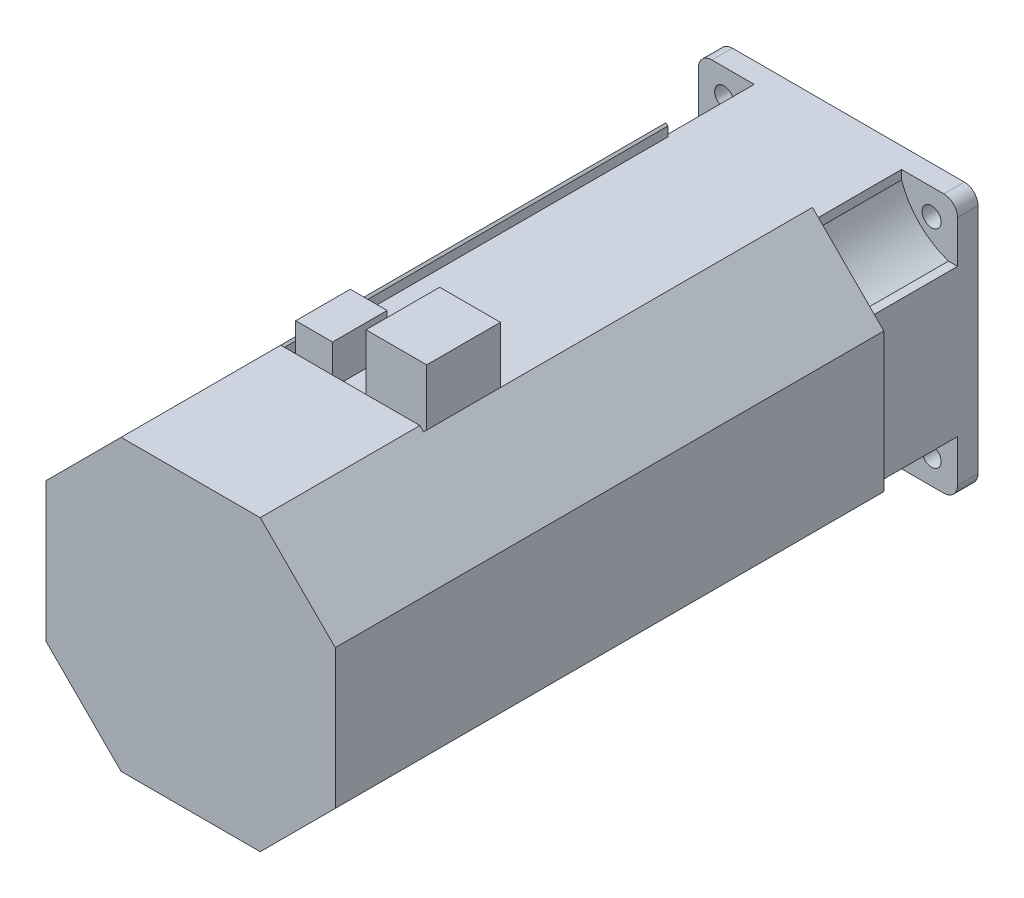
ISO-10303-21;
HEADER;
FILE_DESCRIPTION(('STEP AP214'),'2;1');
FILE_NAME('part.step','',(''),(''),'','','');
FILE_SCHEMA(('AUTOMOTIVE_DESIGN { 1 0 10303 214 1 1 1 1 }'));
ENDSEC;
DATA;
#1=APPLICATION_CONTEXT('core data for automotive mechanical design processes');
#2=APPLICATION_PROTOCOL_DEFINITION('international standard','automotive_design',2000,#1);
#3=PRODUCT_CONTEXT('',#1,'mechanical');
#4=PRODUCT('Part','Part','',(#3));
#5=PRODUCT_RELATED_PRODUCT_CATEGORY('part','',(#4));
#6=PRODUCT_DEFINITION_FORMATION('','',#4);
#7=PRODUCT_DEFINITION_CONTEXT('part definition',#1,'design');
#8=PRODUCT_DEFINITION('design','',#6,#7);
#9=PRODUCT_DEFINITION_SHAPE('','',#8);
#10=(LENGTH_UNIT() NAMED_UNIT(*) SI_UNIT(.MILLI.,.METRE.));
#11=(NAMED_UNIT(*) PLANE_ANGLE_UNIT() SI_UNIT($,.RADIAN.));
#12=(NAMED_UNIT(*) SI_UNIT($,.STERADIAN.) SOLID_ANGLE_UNIT());
#13=UNCERTAINTY_MEASURE_WITH_UNIT(LENGTH_MEASURE(1.E-05),#10,'distance_accuracy_value','');
#14=(GEOMETRIC_REPRESENTATION_CONTEXT(3) GLOBAL_UNCERTAINTY_ASSIGNED_CONTEXT((#13)) GLOBAL_UNIT_ASSIGNED_CONTEXT((#10,
#11,#12)) REPRESENTATION_CONTEXT('',''));
#15=CARTESIAN_POINT('',(0.,0.,0.));
#16=DIRECTION('',(0.,0.,1.));
#17=DIRECTION('',(1.,0.,0.));
#18=AXIS2_PLACEMENT_3D('',#15,#16,#17);
#19=CARTESIAN_POINT('',(-52.2928932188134,101.87867965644,365.));
#20=DIRECTION('',(0.,0.,-1.));
#21=DIRECTION('',(-1.,0.,0.));
#22=AXIS2_PLACEMENT_3D('',#19,#20,#21);
#23=PLANE('',#22);
#24=DIRECTION('',(-1.,0.,0.));
#25=VECTOR('',#24,1.);
#26=CARTESIAN_POINT('',(-52.2928932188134,95.,365.));
#27=LINE('',#26,#25);
#28=CARTESIAN_POINT('',(52.2928932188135,95.,365.));
#29=VERTEX_POINT('',#28);
#30=CARTESIAN_POINT('',(-52.2928932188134,95.,365.));
#31=VERTEX_POINT('',#30);
#32=EDGE_CURVE('E340',#29,#31,#27,.T.);
#33=ORIENTED_EDGE('',*,*,#32,.T.);
#34=DIRECTION('',(0.,-1.,0.));
#35=VECTOR('',#34,1.);
#36=CARTESIAN_POINT('',(-52.2928932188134,101.87867965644,365.));
#37=LINE('',#36,#35);
#38=CARTESIAN_POINT('',(-52.2928932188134,101.87867965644,365.));
#39=VERTEX_POINT('',#38);
#40=EDGE_CURVE('E705',#39,#31,#37,.T.);
#41=ORIENTED_EDGE('',*,*,#40,.F.);
#42=DIRECTION('',(-0.707106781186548,0.707106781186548,0.));
#43=VECTOR('',#42,1.);
#44=CARTESIAN_POINT('',(-53.7071067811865,103.292893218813,365.));
#45=LINE('',#44,#43);
#46=CARTESIAN_POINT('',(-53.7071067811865,103.292893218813,365.));
#47=VERTEX_POINT('',#46);
#48=EDGE_CURVE('E431',#39,#47,#45,.T.);
#49=ORIENTED_EDGE('',*,*,#48,.T.);
#50=DIRECTION('',(0.707106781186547,0.707106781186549,0.));
#51=VECTOR('',#50,1.);
#52=CARTESIAN_POINT('',(-53.7071067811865,103.292893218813,365.));
#53=LINE('',#52,#51);
#54=CARTESIAN_POINT('',(-51.,106.,365.));
#55=VERTEX_POINT('',#54);
#56=EDGE_CURVE('E429',#47,#55,#53,.T.);
#57=ORIENTED_EDGE('',*,*,#56,.T.);
#58=DIRECTION('',(1.,0.,0.));
#59=VECTOR('',#58,1.);
#60=CARTESIAN_POINT('',(-51.,106.,365.));
#61=LINE('',#60,#59);
#62=CARTESIAN_POINT('',(51.,106.,365.));
#63=VERTEX_POINT('',#62);
#64=EDGE_CURVE('E427',#55,#63,#61,.T.);
#65=ORIENTED_EDGE('',*,*,#64,.T.);
#66=DIRECTION('',(0.707106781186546,-0.70710678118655,0.));
#67=VECTOR('',#66,1.);
#68=CARTESIAN_POINT('',(51.,106.,365.));
#69=LINE('',#68,#67);
#70=CARTESIAN_POINT('',(53.7071067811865,103.292893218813,365.));
#71=VERTEX_POINT('',#70);
#72=EDGE_CURVE('E424',#63,#71,#69,.T.);
#73=ORIENTED_EDGE('',*,*,#72,.T.);
#74=DIRECTION('',(-0.707106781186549,-0.707106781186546,0.));
#75=VECTOR('',#74,1.);
#76=CARTESIAN_POINT('',(53.7071067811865,103.292893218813,365.));
#77=LINE('',#76,#75);
#78=CARTESIAN_POINT('',(52.2928932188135,101.87867965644,365.));
#79=VERTEX_POINT('',#78);
#80=EDGE_CURVE('E415',#71,#79,#77,.T.);
#81=ORIENTED_EDGE('',*,*,#80,.T.);
#82=DIRECTION('',(0.,1.,0.));
#83=VECTOR('',#82,1.);
#84=CARTESIAN_POINT('',(52.2928932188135,101.87867965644,365.));
#85=LINE('',#84,#83);
#86=EDGE_CURVE('E703',#29,#79,#85,.T.);
#87=ORIENTED_EDGE('',*,*,#86,.F.);
#88=EDGE_LOOP('',(#33,#41,#49,#57,#65,#73,#81,#87));
#89=FACE_BOUND('',#88,.T.);
#90=ADVANCED_FACE('F15',(#89),#23,.T.);
#91=CARTESIAN_POINT('',(52.9999999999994,144.,308.));
#92=DIRECTION('',(0.,0.,1.));
#93=DIRECTION('',(1.,0.,0.));
#94=AXIS2_PLACEMENT_3D('',#91,#92,#93);
#95=PLANE('',#94);
#96=DIRECTION('',(0.,1.,0.));
#97=VECTOR('',#96,1.);
#98=CARTESIAN_POINT('',(52.2928932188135,144.,308.));
#99=LINE('',#98,#97);
#100=CARTESIAN_POINT('',(52.2928932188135,95.,308.));
#101=VERTEX_POINT('',#100);
#102=CARTESIAN_POINT('',(52.2928932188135,101.87867965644,308.));
#103=VERTEX_POINT('',#102);
#104=EDGE_CURVE('E699',#101,#103,#99,.T.);
#105=ORIENTED_EDGE('',*,*,#104,.F.);
#106=DIRECTION('',(-1.,0.,0.));
#107=VECTOR('',#106,1.);
#108=CARTESIAN_POINT('',(52.9999999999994,95.,308.));
#109=LINE('',#108,#107);
#110=CARTESIAN_POINT('',(8.49999999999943,95.,308.));
#111=VERTEX_POINT('',#110);
#112=EDGE_CURVE('E605',#101,#111,#109,.T.);
#113=ORIENTED_EDGE('',*,*,#112,.T.);
#114=DIRECTION('',(0.,-1.,0.));
#115=VECTOR('',#114,1.);
#116=CARTESIAN_POINT('',(8.49999999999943,144.,308.));
#117=LINE('',#116,#115);
#118=CARTESIAN_POINT('',(8.49999999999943,144.,308.));
#119=VERTEX_POINT('',#118);
#120=EDGE_CURVE('E589',#119,#111,#117,.T.);
#121=ORIENTED_EDGE('',*,*,#120,.F.);
#122=DIRECTION('',(-1.,0.,0.));
#123=VECTOR('',#122,1.);
#124=CARTESIAN_POINT('',(52.9999999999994,144.,308.));
#125=LINE('',#124,#123);
#126=CARTESIAN_POINT('',(52.9999999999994,144.,308.));
#127=VERTEX_POINT('',#126);
#128=EDGE_CURVE('E600',#127,#119,#125,.T.);
#129=ORIENTED_EDGE('',*,*,#128,.F.);
#130=DIRECTION('',(0.,-1.,0.));
#131=VECTOR('',#130,1.);
#132=CARTESIAN_POINT('',(52.9999999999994,144.,308.));
#133=LINE('',#132,#131);
#134=CARTESIAN_POINT('',(52.9999999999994,102.585786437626,308.));
#135=VERTEX_POINT('',#134);
#136=EDGE_CURVE('E586',#127,#135,#133,.T.);
#137=ORIENTED_EDGE('',*,*,#136,.T.);
#138=DIRECTION('',(-0.707106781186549,-0.707106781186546,0.));
#139=VECTOR('',#138,1.);
#140=CARTESIAN_POINT('',(53.7071067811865,103.292893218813,308.));
#141=LINE('',#140,#139);
#142=EDGE_CURVE('E348',#135,#103,#141,.T.);
#143=ORIENTED_EDGE('',*,*,#142,.T.);
#144=EDGE_LOOP('',(#105,#113,#121,#129,#137,#143));
#145=FACE_BOUND('',#144,.T.);
#146=ADVANCED_FACE('F858',(#145),#95,.F.);
#147=CARTESIAN_POINT('',(52.9999999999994,144.,362.));
#148=DIRECTION('',(0.,0.,-1.));
#149=DIRECTION('',(-1.,0.,0.));
#150=AXIS2_PLACEMENT_3D('',#147,#148,#149);
#151=PLANE('',#150);
#152=DIRECTION('',(0.,-1.,0.));
#153=VECTOR('',#152,1.);
#154=CARTESIAN_POINT('',(52.2928932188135,144.,362.));
#155=LINE('',#154,#153);
#156=CARTESIAN_POINT('',(52.2928932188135,101.87867965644,362.));
#157=VERTEX_POINT('',#156);
#158=CARTESIAN_POINT('',(52.2928932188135,95.,362.));
#159=VERTEX_POINT('',#158);
#160=EDGE_CURVE('E23',#157,#159,#155,.T.);
#161=ORIENTED_EDGE('',*,*,#160,.F.);
#162=DIRECTION('',(0.707106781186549,0.707106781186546,0.));
#163=VECTOR('',#162,1.);
#164=CARTESIAN_POINT('',(53.7071067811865,103.292893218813,362.));
#165=LINE('',#164,#163);
#166=CARTESIAN_POINT('',(52.9999999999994,102.585786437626,362.));
#167=VERTEX_POINT('',#166);
#168=EDGE_CURVE('E354',#157,#167,#165,.T.);
#169=ORIENTED_EDGE('',*,*,#168,.T.);
#170=DIRECTION('',(0.,-1.,0.));
#171=VECTOR('',#170,1.);
#172=CARTESIAN_POINT('',(52.9999999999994,144.,362.));
#173=LINE('',#172,#171);
#174=CARTESIAN_POINT('',(52.9999999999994,144.,362.));
#175=VERTEX_POINT('',#174);
#176=EDGE_CURVE('E593',#175,#167,#173,.T.);
#177=ORIENTED_EDGE('',*,*,#176,.F.);
#178=DIRECTION('',(1.,0.,0.));
#179=VECTOR('',#178,1.);
#180=CARTESIAN_POINT('',(52.9999999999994,144.,362.));
#181=LINE('',#180,#179);
#182=CARTESIAN_POINT('',(8.49999999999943,144.,362.));
#183=VERTEX_POINT('',#182);
#184=EDGE_CURVE('E596',#183,#175,#181,.T.);
#185=ORIENTED_EDGE('',*,*,#184,.F.);
#186=DIRECTION('',(0.,-1.,0.));
#187=VECTOR('',#186,1.);
#188=CARTESIAN_POINT('',(8.49999999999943,144.,362.));
#189=LINE('',#188,#187);
#190=CARTESIAN_POINT('',(8.49999999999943,95.,362.));
#191=VERTEX_POINT('',#190);
#192=EDGE_CURVE('E328',#183,#191,#189,.T.);
#193=ORIENTED_EDGE('',*,*,#192,.T.);
#194=DIRECTION('',(1.,0.,0.));
#195=VECTOR('',#194,1.);
#196=CARTESIAN_POINT('',(52.9999999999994,95.,362.));
#197=LINE('',#196,#195);
#198=EDGE_CURVE('E320',#191,#159,#197,.T.);
#199=ORIENTED_EDGE('',*,*,#198,.T.);
#200=EDGE_LOOP('',(#161,#169,#177,#185,#193,#199));
#201=FACE_BOUND('',#200,.T.);
#202=ADVANCED_FACE('F322',(#201),#151,.F.);
#203=CARTESIAN_POINT('',(53.7071067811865,103.292893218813,365.));
#204=DIRECTION('',(0.707106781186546,-0.707106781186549,0.));
#205=DIRECTION('',(0.707106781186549,0.707106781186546,0.));
#206=AXIS2_PLACEMENT_3D('',#203,#204,#205);
#207=PLANE('',#206);
#208=ORIENTED_EDGE('',*,*,#142,.F.);
#209=DIRECTION('',(0.,0.,-1.));
#210=VECTOR('',#209,1.);
#211=CARTESIAN_POINT('',(52.9999999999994,102.585786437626,365.));
#212=LINE('',#211,#210);
#213=EDGE_CURVE('E349',#167,#135,#212,.T.);
#214=ORIENTED_EDGE('',*,*,#213,.F.);
#215=ORIENTED_EDGE('',*,*,#168,.F.);
#216=DIRECTION('',(0.,0.,-1.));
#217=VECTOR('',#216,1.);
#218=CARTESIAN_POINT('',(52.2928932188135,101.87867965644,365.));
#219=LINE('',#218,#217);
#220=EDGE_CURVE('E347',#79,#157,#219,.T.);
#221=ORIENTED_EDGE('',*,*,#220,.F.);
#222=ORIENTED_EDGE('',*,*,#80,.F.);
#223=DIRECTION('',(0.,0.,-1.));
#224=VECTOR('',#223,1.);
#225=CARTESIAN_POINT('',(53.7071067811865,103.292893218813,365.));
#226=LINE('',#225,#224);
#227=CARTESIAN_POINT('',(53.7071067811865,103.292893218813,80.));
#228=VERTEX_POINT('',#227);
#229=EDGE_CURVE('E418',#71,#228,#226,.T.);
#230=ORIENTED_EDGE('',*,*,#229,.T.);
#231=DIRECTION('',(-0.707106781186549,-0.707106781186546,0.));
#232=VECTOR('',#231,1.);
#233=CARTESIAN_POINT('',(53.7071067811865,103.292893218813,80.));
#234=LINE('',#233,#232);
#235=CARTESIAN_POINT('',(52.2928932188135,101.87867965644,80.));
#236=VERTEX_POINT('',#235);
#237=EDGE_CURVE('E434',#228,#236,#234,.T.);
#238=ORIENTED_EDGE('',*,*,#237,.T.);
#239=EDGE_CURVE('E420',#103,#236,#219,.T.);
#240=ORIENTED_EDGE('',*,*,#239,.F.);
#241=EDGE_LOOP('',(#208,#214,#215,#221,#222,#230,#238,#240));
#242=FACE_BOUND('',#241,.T.);
#243=ADVANCED_FACE('F717',(#242),#207,.F.);
#244=CARTESIAN_POINT('',(-51.,106.,80.));
#245=DIRECTION('',(0.,-1.,0.));
#246=DIRECTION('',(1.,0.,0.));
#247=AXIS2_PLACEMENT_3D('',#244,#245,#246);
#248=PLANE('',#247);
#249=ORIENTED_EDGE('',*,*,#64,.F.);
#250=DIRECTION('',(0.,0.,1.));
#251=VECTOR('',#250,1.);
#252=CARTESIAN_POINT('',(-51.,106.,80.));
#253=LINE('',#252,#251);
#254=CARTESIAN_POINT('',(-51.,106.,482.));
#255=VERTEX_POINT('',#254);
#256=EDGE_CURVE('E371',#55,#255,#253,.T.);
#257=ORIENTED_EDGE('',*,*,#256,.T.);
#258=DIRECTION('',(1.,0.,0.));
#259=VECTOR('',#258,1.);
#260=CARTESIAN_POINT('',(-51.,106.,482.));
#261=LINE('',#260,#259);
#262=CARTESIAN_POINT('',(51.,106.,482.));
#263=VERTEX_POINT('',#262);
#264=EDGE_CURVE('E409',#255,#263,#261,.T.);
#265=ORIENTED_EDGE('',*,*,#264,.T.);
#266=DIRECTION('',(0.,0.,1.));
#267=VECTOR('',#266,1.);
#268=CARTESIAN_POINT('',(51.,106.,80.));
#269=LINE('',#268,#267);
#270=EDGE_CURVE('E357',#63,#263,#269,.T.);
#271=ORIENTED_EDGE('',*,*,#270,.F.);
#272=EDGE_LOOP('',(#249,#257,#265,#271));
#273=FACE_BOUND('',#272,.T.);
#274=ADVANCED_FACE('F17',(#273),#248,.F.);
#275=CARTESIAN_POINT('',(51.,106.,80.));
#276=DIRECTION('',(-0.707106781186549,-0.707106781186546,0.));
#277=DIRECTION('',(0.707106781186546,-0.707106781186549,0.));
#278=AXIS2_PLACEMENT_3D('',#275,#276,#277);
#279=PLANE('',#278);
#280=ORIENTED_EDGE('',*,*,#229,.F.);
#281=ORIENTED_EDGE('',*,*,#72,.F.);
#282=ORIENTED_EDGE('',*,*,#270,.T.);
#283=DIRECTION('',(0.707106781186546,-0.707106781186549,0.));
#284=VECTOR('',#283,1.);
#285=CARTESIAN_POINT('',(51.,106.,482.));
#286=LINE('',#285,#284);
#287=CARTESIAN_POINT('',(106.,51.,482.));
#288=VERTEX_POINT('',#287);
#289=EDGE_CURVE('E406',#263,#288,#286,.T.);
#290=ORIENTED_EDGE('',*,*,#289,.T.);
#291=DIRECTION('',(0.,0.,1.));
#292=VECTOR('',#291,1.);
#293=CARTESIAN_POINT('',(106.,51.,80.));
#294=LINE('',#293,#292);
#295=CARTESIAN_POINT('',(106.,51.,80.));
#296=VERTEX_POINT('',#295);
#297=EDGE_CURVE('E359',#296,#288,#294,.T.);
#298=ORIENTED_EDGE('',*,*,#297,.F.);
#299=DIRECTION('',(0.707106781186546,-0.707106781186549,0.));
#300=VECTOR('',#299,1.);
#301=CARTESIAN_POINT('',(51.,106.,80.));
#302=LINE('',#301,#300);
#303=EDGE_CURVE('E386',#228,#296,#302,.T.);
#304=ORIENTED_EDGE('',*,*,#303,.F.);
#305=EDGE_LOOP('',(#280,#281,#282,#290,#298,#304));
#306=FACE_BOUND('',#305,.T.);
#307=ADVANCED_FACE('F828',(#306),#279,.F.);
#308=CARTESIAN_POINT('',(106.,51.,80.));
#309=DIRECTION('',(-1.,0.,0.));
#310=DIRECTION('',(0.,-1.,0.));
#311=AXIS2_PLACEMENT_3D('',#308,#309,#310);
#312=PLANE('',#311);
#313=ORIENTED_EDGE('',*,*,#297,.T.);
#314=DIRECTION('',(0.,-1.,0.));
#315=VECTOR('',#314,1.);
#316=CARTESIAN_POINT('',(106.,51.,482.));
#317=LINE('',#316,#315);
#318=CARTESIAN_POINT('',(106.,-51.,482.));
#319=VERTEX_POINT('',#318);
#320=EDGE_CURVE('E403',#288,#319,#317,.T.);
#321=ORIENTED_EDGE('',*,*,#320,.T.);
#322=DIRECTION('',(0.,0.,1.));
#323=VECTOR('',#322,1.);
#324=CARTESIAN_POINT('',(106.,-51.,80.));
#325=LINE('',#324,#323);
#326=CARTESIAN_POINT('',(106.,-51.,80.));
#327=VERTEX_POINT('',#326);
#328=EDGE_CURVE('E361',#327,#319,#325,.T.);
#329=ORIENTED_EDGE('',*,*,#328,.F.);
#330=DIRECTION('',(0.,-1.,0.));
#331=VECTOR('',#330,1.);
#332=CARTESIAN_POINT('',(106.,51.,80.));
#333=LINE('',#332,#331);
#334=EDGE_CURVE('E384',#296,#327,#333,.T.);
#335=ORIENTED_EDGE('',*,*,#334,.F.);
#336=EDGE_LOOP('',(#313,#321,#329,#335));
#337=FACE_BOUND('',#336,.T.);
#338=ADVANCED_FACE('F835',(#337),#312,.F.);
#339=CARTESIAN_POINT('',(51.,-106.,80.));
#340=DIRECTION('',(-0.707106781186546,0.707106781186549,0.));
#341=DIRECTION('',(-0.707106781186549,-0.707106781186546,0.));
#342=AXIS2_PLACEMENT_3D('',#339,#340,#341);
#343=PLANE('',#342);
#344=ORIENTED_EDGE('',*,*,#328,.T.);
#345=DIRECTION('',(-0.707106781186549,-0.707106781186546,0.));
#346=VECTOR('',#345,1.);
#347=CARTESIAN_POINT('',(51.,-106.,482.));
#348=LINE('',#347,#346);
#349=CARTESIAN_POINT('',(51.,-106.,482.));
#350=VERTEX_POINT('',#349);
#351=EDGE_CURVE('E400',#319,#350,#348,.T.);
#352=ORIENTED_EDGE('',*,*,#351,.T.);
#353=DIRECTION('',(0.,0.,1.));
#354=VECTOR('',#353,1.);
#355=CARTESIAN_POINT('',(51.,-106.,80.));
#356=LINE('',#355,#354);
#357=CARTESIAN_POINT('',(51.,-106.,80.));
#358=VERTEX_POINT('',#357);
#359=EDGE_CURVE('E363',#358,#350,#356,.T.);
#360=ORIENTED_EDGE('',*,*,#359,.F.);
#361=DIRECTION('',(-0.707106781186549,-0.707106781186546,0.));
#362=VECTOR('',#361,1.);
#363=CARTESIAN_POINT('',(51.,-106.,80.));
#364=LINE('',#363,#362);
#365=EDGE_CURVE('E382',#327,#358,#364,.T.);
#366=ORIENTED_EDGE('',*,*,#365,.F.);
#367=EDGE_LOOP('',(#344,#352,#360,#366));
#368=FACE_BOUND('',#367,.T.);
#369=ADVANCED_FACE('F838',(#368),#343,.F.);
#370=CARTESIAN_POINT('',(-51.,-106.,80.));
#371=DIRECTION('',(0.,1.,0.));
#372=DIRECTION('',(-1.,0.,0.));
#373=AXIS2_PLACEMENT_3D('',#370,#371,#372);
#374=PLANE('',#373);
#375=ORIENTED_EDGE('',*,*,#359,.T.);
#376=DIRECTION('',(-1.,0.,0.));
#377=VECTOR('',#376,1.);
#378=CARTESIAN_POINT('',(-51.,-106.,482.));
#379=LINE('',#378,#377);
#380=CARTESIAN_POINT('',(-51.,-106.,482.));
#381=VERTEX_POINT('',#380);
#382=EDGE_CURVE('E397',#350,#381,#379,.T.);
#383=ORIENTED_EDGE('',*,*,#382,.T.);
#384=DIRECTION('',(0.,0.,1.));
#385=VECTOR('',#384,1.);
#386=CARTESIAN_POINT('',(-51.,-106.,80.));
#387=LINE('',#386,#385);
#388=CARTESIAN_POINT('',(-51.,-106.,80.));
#389=VERTEX_POINT('',#388);
#390=EDGE_CURVE('E365',#389,#381,#387,.T.);
#391=ORIENTED_EDGE('',*,*,#390,.F.);
#392=DIRECTION('',(-1.,0.,0.));
#393=VECTOR('',#392,1.);
#394=CARTESIAN_POINT('',(-51.,-106.,80.));
#395=LINE('',#394,#393);
#396=EDGE_CURVE('E380',#358,#389,#395,.T.);
#397=ORIENTED_EDGE('',*,*,#396,.F.);
#398=EDGE_LOOP('',(#375,#383,#391,#397));
#399=FACE_BOUND('',#398,.T.);
#400=ADVANCED_FACE('F843',(#399),#374,.F.);
#401=CARTESIAN_POINT('',(-106.,-51.,80.));
#402=DIRECTION('',(0.707106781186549,0.707106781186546,0.));
#403=DIRECTION('',(-0.707106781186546,0.707106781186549,0.));
#404=AXIS2_PLACEMENT_3D('',#401,#402,#403);
#405=PLANE('',#404);
#406=ORIENTED_EDGE('',*,*,#390,.T.);
#407=DIRECTION('',(-0.707106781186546,0.707106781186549,0.));
#408=VECTOR('',#407,1.);
#409=CARTESIAN_POINT('',(-106.,-51.,482.));
#410=LINE('',#409,#408);
#411=CARTESIAN_POINT('',(-106.,-51.,482.));
#412=VERTEX_POINT('',#411);
#413=EDGE_CURVE('E394',#381,#412,#410,.T.);
#414=ORIENTED_EDGE('',*,*,#413,.T.);
#415=DIRECTION('',(0.,0.,1.));
#416=VECTOR('',#415,1.);
#417=CARTESIAN_POINT('',(-106.,-51.,80.));
#418=LINE('',#417,#416);
#419=CARTESIAN_POINT('',(-106.,-51.,80.));
#420=VERTEX_POINT('',#419);
#421=EDGE_CURVE('E367',#420,#412,#418,.T.);
#422=ORIENTED_EDGE('',*,*,#421,.F.);
#423=DIRECTION('',(-0.707106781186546,0.707106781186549,0.));
#424=VECTOR('',#423,1.);
#425=CARTESIAN_POINT('',(-106.,-51.,80.));
#426=LINE('',#425,#424);
#427=EDGE_CURVE('E378',#389,#420,#426,.T.);
#428=ORIENTED_EDGE('',*,*,#427,.F.);
#429=EDGE_LOOP('',(#406,#414,#422,#428));
#430=FACE_BOUND('',#429,.T.);
#431=ADVANCED_FACE('F846',(#430),#405,.F.);
#432=CARTESIAN_POINT('',(-106.,51.,80.));
#433=DIRECTION('',(1.,0.,0.));
#434=DIRECTION('',(0.,1.,0.));
#435=AXIS2_PLACEMENT_3D('',#432,#433,#434);
#436=PLANE('',#435);
#437=ORIENTED_EDGE('',*,*,#421,.T.);
#438=DIRECTION('',(0.,1.,0.));
#439=VECTOR('',#438,1.);
#440=CARTESIAN_POINT('',(-106.,51.,482.));
#441=LINE('',#440,#439);
#442=CARTESIAN_POINT('',(-106.,51.,482.));
#443=VERTEX_POINT('',#442);
#444=EDGE_CURVE('E391',#412,#443,#441,.T.);
#445=ORIENTED_EDGE('',*,*,#444,.T.);
#446=DIRECTION('',(0.,0.,1.));
#447=VECTOR('',#446,1.);
#448=CARTESIAN_POINT('',(-106.,51.,80.));
#449=LINE('',#448,#447);
#450=CARTESIAN_POINT('',(-106.,51.,80.));
#451=VERTEX_POINT('',#450);
#452=EDGE_CURVE('E369',#451,#443,#449,.T.);
#453=ORIENTED_EDGE('',*,*,#452,.F.);
#454=DIRECTION('',(0.,1.,0.));
#455=VECTOR('',#454,1.);
#456=CARTESIAN_POINT('',(-106.,51.,80.));
#457=LINE('',#456,#455);
#458=EDGE_CURVE('E376',#420,#451,#457,.T.);
#459=ORIENTED_EDGE('',*,*,#458,.F.);
#460=EDGE_LOOP('',(#437,#445,#453,#459));
#461=FACE_BOUND('',#460,.T.);
#462=ADVANCED_FACE('F816',(#461),#436,.F.);
#463=CARTESIAN_POINT('',(-106.,51.,80.));
#464=DIRECTION('',(0.707106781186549,-0.707106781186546,0.));
#465=DIRECTION('',(0.707106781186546,0.707106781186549,0.));
#466=AXIS2_PLACEMENT_3D('',#463,#464,#465);
#467=PLANE('',#466);
#468=ORIENTED_EDGE('',*,*,#452,.T.);
#469=DIRECTION('',(0.707106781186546,0.707106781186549,0.));
#470=VECTOR('',#469,1.);
#471=CARTESIAN_POINT('',(-106.,51.,482.));
#472=LINE('',#471,#470);
#473=EDGE_CURVE('E388',#443,#255,#472,.T.);
#474=ORIENTED_EDGE('',*,*,#473,.T.);
#475=ORIENTED_EDGE('',*,*,#256,.F.);
#476=ORIENTED_EDGE('',*,*,#56,.F.);
#477=DIRECTION('',(0.,0.,-1.));
#478=VECTOR('',#477,1.);
#479=CARTESIAN_POINT('',(-53.7071067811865,103.292893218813,365.));
#480=LINE('',#479,#478);
#481=CARTESIAN_POINT('',(-53.7071067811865,103.292893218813,80.));
#482=VERTEX_POINT('',#481);
#483=EDGE_CURVE('E414',#47,#482,#480,.T.);
#484=ORIENTED_EDGE('',*,*,#483,.T.);
#485=DIRECTION('',(0.707106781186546,0.707106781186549,0.));
#486=VECTOR('',#485,1.);
#487=CARTESIAN_POINT('',(-106.,51.,80.));
#488=LINE('',#487,#486);
#489=EDGE_CURVE('E373',#451,#482,#488,.T.);
#490=ORIENTED_EDGE('',*,*,#489,.F.);
#491=EDGE_LOOP('',(#468,#474,#475,#476,#484,#490));
#492=FACE_BOUND('',#491,.T.);
#493=ADVANCED_FACE('F809',(#492),#467,.F.);
#494=CARTESIAN_POINT('',(-106.,106.,80.));
#495=DIRECTION('',(0.,0.,-1.));
#496=DIRECTION('',(-1.,0.,0.));
#497=AXIS2_PLACEMENT_3D('',#494,#495,#496);
#498=PLANE('',#497);
#499=ORIENTED_EDGE('',*,*,#237,.F.);
#500=ORIENTED_EDGE('',*,*,#303,.T.);
#501=ORIENTED_EDGE('',*,*,#334,.T.);
#502=ORIENTED_EDGE('',*,*,#365,.T.);
#503=ORIENTED_EDGE('',*,*,#396,.T.);
#504=ORIENTED_EDGE('',*,*,#427,.T.);
#505=ORIENTED_EDGE('',*,*,#458,.T.);
#506=ORIENTED_EDGE('',*,*,#489,.T.);
#507=DIRECTION('',(-0.707106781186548,0.707106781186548,0.));
#508=VECTOR('',#507,1.);
#509=CARTESIAN_POINT('',(-53.7071067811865,103.292893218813,80.));
#510=LINE('',#509,#508);
#511=CARTESIAN_POINT('',(-52.2928932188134,101.87867965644,80.));
#512=VERTEX_POINT('',#511);
#513=EDGE_CURVE('E436',#512,#482,#510,.T.);
#514=ORIENTED_EDGE('',*,*,#513,.F.);
#515=DIRECTION('',(0.,-1.,0.));
#516=VECTOR('',#515,1.);
#517=CARTESIAN_POINT('',(-52.2928932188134,101.87867965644,80.));
#518=LINE('',#517,#516);
#519=CARTESIAN_POINT('',(-52.2928932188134,95.,80.));
#520=VERTEX_POINT('',#519);
#521=EDGE_CURVE('E706',#512,#520,#518,.T.);
#522=ORIENTED_EDGE('',*,*,#521,.T.);
#523=DIRECTION('',(1.,0.,0.));
#524=VECTOR('',#523,1.);
#525=CARTESIAN_POINT('',(-85.,95.,80.));
#526=LINE('',#525,#524);
#527=CARTESIAN_POINT('',(-54.,95.,80.));
#528=VERTEX_POINT('',#527);
#529=EDGE_CURVE('E30',#528,#520,#526,.T.);
#530=ORIENTED_EDGE('',*,*,#529,.F.);
#531=DIRECTION('',(0.,-1.,0.));
#532=VECTOR('',#531,1.);
#533=CARTESIAN_POINT('',(-54.,88.3423083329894,80.));
#534=LINE('',#533,#532);
#535=CARTESIAN_POINT('',(-54.,88.3423083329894,80.));
#536=VERTEX_POINT('',#535);
#537=EDGE_CURVE('E658',#528,#536,#534,.T.);
#538=ORIENTED_EDGE('',*,*,#537,.T.);
#539=CARTESIAN_POINT('',(-106.066017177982,106.066017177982,80.));
#540=DIRECTION('',(0.,0.,-1.));
#541=DIRECTION('',(-1.,0.,0.));
#542=AXIS2_PLACEMENT_3D('',#539,#540,#541);
#543=CIRCLE('',#542,55.);
#544=CARTESIAN_POINT('',(-88.3423083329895,54.,80.));
#545=VERTEX_POINT('',#544);
#546=EDGE_CURVE('E661',#536,#545,#543,.T.);
#547=ORIENTED_EDGE('',*,*,#546,.T.);
#548=DIRECTION('',(-1.,0.,0.));
#549=VECTOR('',#548,1.);
#550=CARTESIAN_POINT('',(-88.3423083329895,54.,80.));
#551=LINE('',#550,#549);
#552=CARTESIAN_POINT('',(-95.,54.,80.));
#553=VERTEX_POINT('',#552);
#554=EDGE_CURVE('E664',#545,#553,#551,.T.);
#555=ORIENTED_EDGE('',*,*,#554,.T.);
#556=DIRECTION('',(0.,1.,0.));
#557=VECTOR('',#556,1.);
#558=CARTESIAN_POINT('',(-95.,85.,80.));
#559=LINE('',#558,#557);
#560=CARTESIAN_POINT('',(-95.,-54.,80.));
#561=VERTEX_POINT('',#560);
#562=EDGE_CURVE('E667',#561,#553,#559,.T.);
#563=ORIENTED_EDGE('',*,*,#562,.F.);
#564=DIRECTION('',(1.,0.,0.));
#565=VECTOR('',#564,1.);
#566=CARTESIAN_POINT('',(-88.3423083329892,-54.,80.));
#567=LINE('',#566,#565);
#568=CARTESIAN_POINT('',(-88.3423083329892,-54.,80.));
#569=VERTEX_POINT('',#568);
#570=EDGE_CURVE('E669',#561,#569,#567,.T.);
#571=ORIENTED_EDGE('',*,*,#570,.T.);
#572=CARTESIAN_POINT('',(-106.066017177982,-106.066017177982,80.));
#573=DIRECTION('',(0.,0.,-1.));
#574=DIRECTION('',(-1.,0.,0.));
#575=AXIS2_PLACEMENT_3D('',#572,#573,#574);
#576=CIRCLE('',#575,55.);
#577=CARTESIAN_POINT('',(-54.,-88.3423083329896,80.));
#578=VERTEX_POINT('',#577);
#579=EDGE_CURVE('E672',#569,#578,#576,.T.);
#580=ORIENTED_EDGE('',*,*,#579,.T.);
#581=DIRECTION('',(0.,-1.,0.));
#582=VECTOR('',#581,1.);
#583=CARTESIAN_POINT('',(-54.,-88.3423083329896,80.));
#584=LINE('',#583,#582);
#585=CARTESIAN_POINT('',(-54.,-95.,80.));
#586=VERTEX_POINT('',#585);
#587=EDGE_CURVE('E675',#578,#586,#584,.T.);
#588=ORIENTED_EDGE('',*,*,#587,.T.);
#589=DIRECTION('',(-1.,0.,0.));
#590=VECTOR('',#589,1.);
#591=CARTESIAN_POINT('',(-85.,-95.,80.));
#592=LINE('',#591,#590);
#593=CARTESIAN_POINT('',(54.0000000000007,-95.,80.));
#594=VERTEX_POINT('',#593);
#595=EDGE_CURVE('E678',#594,#586,#592,.T.);
#596=ORIENTED_EDGE('',*,*,#595,.F.);
#597=DIRECTION('',(0.,1.,0.));
#598=VECTOR('',#597,1.);
#599=CARTESIAN_POINT('',(54.0000000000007,-88.3423083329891,80.));
#600=LINE('',#599,#598);
#601=CARTESIAN_POINT('',(54.0000000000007,-88.3423083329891,80.));
#602=VERTEX_POINT('',#601);
#603=EDGE_CURVE('E680',#594,#602,#600,.T.);
#604=ORIENTED_EDGE('',*,*,#603,.T.);
#605=CARTESIAN_POINT('',(106.066017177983,-106.066017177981,80.));
#606=DIRECTION('',(0.,0.,-1.));
#607=DIRECTION('',(-1.,0.,0.));
#608=AXIS2_PLACEMENT_3D('',#605,#606,#607);
#609=CIRCLE('',#608,55.);
#610=CARTESIAN_POINT('',(88.3423083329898,-53.9999999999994,80.));
#611=VERTEX_POINT('',#610);
#612=EDGE_CURVE('E683',#602,#611,#609,.T.);
#613=ORIENTED_EDGE('',*,*,#612,.T.);
#614=DIRECTION('',(1.,0.,0.));
#615=VECTOR('',#614,1.);
#616=CARTESIAN_POINT('',(88.3423083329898,-53.9999999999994,80.));
#617=LINE('',#616,#615);
#618=CARTESIAN_POINT('',(95.,-53.9999999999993,80.));
#619=VERTEX_POINT('',#618);
#620=EDGE_CURVE('E686',#611,#619,#617,.T.);
#621=ORIENTED_EDGE('',*,*,#620,.T.);
#622=DIRECTION('',(0.,-1.,0.));
#623=VECTOR('',#622,1.);
#624=CARTESIAN_POINT('',(95.,85.,80.));
#625=LINE('',#624,#623);
#626=CARTESIAN_POINT('',(95.,54.000000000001,80.));
#627=VERTEX_POINT('',#626);
#628=EDGE_CURVE('E689',#627,#619,#625,.T.);
#629=ORIENTED_EDGE('',*,*,#628,.F.);
#630=DIRECTION('',(-1.,0.,0.));
#631=VECTOR('',#630,1.);
#632=CARTESIAN_POINT('',(88.3423083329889,54.000000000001,80.));
#633=LINE('',#632,#631);
#634=CARTESIAN_POINT('',(88.3423083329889,54.000000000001,80.));
#635=VERTEX_POINT('',#634);
#636=EDGE_CURVE('E691',#627,#635,#633,.T.);
#637=ORIENTED_EDGE('',*,*,#636,.T.);
#638=CARTESIAN_POINT('',(106.066017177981,106.066017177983,80.));
#639=DIRECTION('',(0.,0.,-1.));
#640=DIRECTION('',(-1.,0.,0.));
#641=AXIS2_PLACEMENT_3D('',#638,#639,#640);
#642=CIRCLE('',#641,55.);
#643=CARTESIAN_POINT('',(53.9999999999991,88.34230833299,80.));
#644=VERTEX_POINT('',#643);
#645=EDGE_CURVE('E696',#635,#644,#642,.T.);
#646=ORIENTED_EDGE('',*,*,#645,.T.);
#647=DIRECTION('',(0.,1.,0.));
#648=VECTOR('',#647,1.);
#649=CARTESIAN_POINT('',(53.9999999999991,88.34230833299,80.));
#650=LINE('',#649,#648);
#651=CARTESIAN_POINT('',(53.999999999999,95.,80.));
#652=VERTEX_POINT('',#651);
#653=EDGE_CURVE('E10',#644,#652,#650,.T.);
#654=ORIENTED_EDGE('',*,*,#653,.T.);
#655=CARTESIAN_POINT('',(52.2928932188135,95.,80.));
#656=VERTEX_POINT('',#655);
#657=EDGE_CURVE('E694',#656,#652,#526,.T.);
#658=ORIENTED_EDGE('',*,*,#657,.F.);
#659=DIRECTION('',(0.,1.,0.));
#660=VECTOR('',#659,1.);
#661=CARTESIAN_POINT('',(52.2928932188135,101.87867965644,80.));
#662=LINE('',#661,#660);
#663=EDGE_CURVE('E701',#656,#236,#662,.T.);
#664=ORIENTED_EDGE('',*,*,#663,.T.);
#665=EDGE_LOOP('',(#499,#500,#501,#502,#503,#504,#505,#506,#514,#522,#530,#538,#547,#555,#563,
#571,#580,#588,#596,#604,#613,#621,#629,#637,#646,#654,#658,#664));
#666=FACE_BOUND('',#665,.T.);
#667=ADVANCED_FACE('F737',(#666),#498,.T.);
#668=CARTESIAN_POINT('',(-106.,106.,482.));
#669=DIRECTION('',(0.,0.,-1.));
#670=DIRECTION('',(-1.,0.,0.));
#671=AXIS2_PLACEMENT_3D('',#668,#669,#670);
#672=PLANE('',#671);
#673=ORIENTED_EDGE('',*,*,#264,.F.);
#674=ORIENTED_EDGE('',*,*,#473,.F.);
#675=ORIENTED_EDGE('',*,*,#444,.F.);
#676=ORIENTED_EDGE('',*,*,#413,.F.);
#677=ORIENTED_EDGE('',*,*,#382,.F.);
#678=ORIENTED_EDGE('',*,*,#351,.F.);
#679=ORIENTED_EDGE('',*,*,#320,.F.);
#680=ORIENTED_EDGE('',*,*,#289,.F.);
#681=EDGE_LOOP('',(#673,#674,#675,#676,#677,#678,#679,#680));
#682=FACE_BOUND('',#681,.T.);
#683=ADVANCED_FACE('F822',(#682),#672,.F.);
#684=CARTESIAN_POINT('',(-53.7071067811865,103.292893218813,365.));
#685=DIRECTION('',(-0.707106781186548,-0.707106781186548,0.));
#686=DIRECTION('',(0.707106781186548,-0.707106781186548,0.));
#687=AXIS2_PLACEMENT_3D('',#684,#685,#686);
#688=PLANE('',#687);
#689=ORIENTED_EDGE('',*,*,#513,.T.);
#690=ORIENTED_EDGE('',*,*,#483,.F.);
#691=ORIENTED_EDGE('',*,*,#48,.F.);
#692=DIRECTION('',(0.,0.,-1.));
#693=VECTOR('',#692,1.);
#694=CARTESIAN_POINT('',(-52.2928932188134,101.87867965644,365.));
#695=LINE('',#694,#693);
#696=EDGE_CURVE('E412',#39,#512,#695,.T.);
#697=ORIENTED_EDGE('',*,*,#696,.T.);
#698=EDGE_LOOP('',(#689,#690,#691,#697));
#699=FACE_BOUND('',#698,.T.);
#700=ADVANCED_FACE('F806',(#699),#688,.F.);
#701=CARTESIAN_POINT('',(52.9999999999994,144.,308.));
#702=DIRECTION('',(-1.,0.,0.));
#703=DIRECTION('',(0.,0.,1.));
#704=AXIS2_PLACEMENT_3D('',#701,#702,#703);
#705=PLANE('',#704);
#706=ORIENTED_EDGE('',*,*,#176,.T.);
#707=ORIENTED_EDGE('',*,*,#213,.T.);
#708=ORIENTED_EDGE('',*,*,#136,.F.);
#709=DIRECTION('',(0.,0.,-1.));
#710=VECTOR('',#709,1.);
#711=CARTESIAN_POINT('',(52.9999999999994,144.,308.));
#712=LINE('',#711,#710);
#713=EDGE_CURVE('E331',#175,#127,#712,.T.);
#714=ORIENTED_EDGE('',*,*,#713,.F.);
#715=EDGE_LOOP('',(#706,#707,#708,#714));
#716=FACE_BOUND('',#715,.T.);
#717=ADVANCED_FACE('F722',(#716),#705,.F.);
#718=CARTESIAN_POINT('',(-85.,95.,380.));
#719=DIRECTION('',(0.,-1.,0.));
#720=DIRECTION('',(1.,0.,0.));
#721=AXIS2_PLACEMENT_3D('',#718,#719,#720);
#722=PLANE('',#721);
#723=DIRECTION('',(0.,0.,-1.));
#724=VECTOR('',#723,1.);
#725=CARTESIAN_POINT('',(-54.,95.,380.));
#726=LINE('',#725,#724);
#727=CARTESIAN_POINT('',(-54.,95.,15.));
#728=VERTEX_POINT('',#727);
#729=EDGE_CURVE('E486',#528,#728,#726,.T.);
#730=ORIENTED_EDGE('',*,*,#729,.F.);
#731=ORIENTED_EDGE('',*,*,#529,.T.);
#732=DIRECTION('',(0.,0.,1.));
#733=VECTOR('',#732,1.);
#734=CARTESIAN_POINT('',(-52.2928932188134,95.,-217.905211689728));
#735=LINE('',#734,#733);
#736=EDGE_CURVE('E343',#520,#31,#735,.T.);
#737=ORIENTED_EDGE('',*,*,#736,.T.);
#738=ORIENTED_EDGE('',*,*,#32,.F.);
#739=DIRECTION('',(0.,0.,1.));
#740=VECTOR('',#739,1.);
#741=CARTESIAN_POINT('',(52.2928932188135,95.,-217.905211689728));
#742=LINE('',#741,#740);
#743=EDGE_CURVE('E336',#159,#29,#742,.T.);
#744=ORIENTED_EDGE('',*,*,#743,.F.);
#745=ORIENTED_EDGE('',*,*,#198,.F.);
#746=DIRECTION('',(0.,0.,1.));
#747=VECTOR('',#746,1.);
#748=CARTESIAN_POINT('',(8.49999999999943,95.,308.));
#749=LINE('',#748,#747);
#750=EDGE_CURVE('E332',#111,#191,#749,.T.);
#751=ORIENTED_EDGE('',*,*,#750,.F.);
#752=ORIENTED_EDGE('',*,*,#112,.F.);
#753=EDGE_CURVE('E37',#656,#101,#742,.T.);
#754=ORIENTED_EDGE('',*,*,#753,.F.);
#755=ORIENTED_EDGE('',*,*,#657,.T.);
#756=DIRECTION('',(0.,0.,-1.));
#757=VECTOR('',#756,1.);
#758=CARTESIAN_POINT('',(53.999999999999,95.,380.));
#759=LINE('',#758,#757);
#760=CARTESIAN_POINT('',(53.999999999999,95.,15.));
#761=VERTEX_POINT('',#760);
#762=EDGE_CURVE('E560',#652,#761,#759,.T.);
#763=ORIENTED_EDGE('',*,*,#762,.T.);
#764=DIRECTION('',(-1.,0.,0.));
#765=VECTOR('',#764,1.);
#766=CARTESIAN_POINT('',(84.999999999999,95.,15.));
#767=LINE('',#766,#765);
#768=CARTESIAN_POINT('',(84.999999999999,95.,15.));
#769=VERTEX_POINT('',#768);
#770=EDGE_CURVE('E567',#769,#761,#767,.T.);
#771=ORIENTED_EDGE('',*,*,#770,.F.);
#772=DIRECTION('',(0.,0.,-1.));
#773=VECTOR('',#772,1.);
#774=CARTESIAN_POINT('',(85.,95.,380.));
#775=LINE('',#774,#773);
#776=CARTESIAN_POINT('',(85.,95.,0.));
#777=VERTEX_POINT('',#776);
#778=EDGE_CURVE('E450',#769,#777,#775,.T.);
#779=ORIENTED_EDGE('',*,*,#778,.T.);
#780=DIRECTION('',(-1.,0.,0.));
#781=VECTOR('',#780,1.);
#782=CARTESIAN_POINT('',(-85.,95.,0.));
#783=LINE('',#782,#781);
#784=CARTESIAN_POINT('',(-85.,95.,0.));
#785=VERTEX_POINT('',#784);
#786=EDGE_CURVE('E454',#777,#785,#783,.T.);
#787=ORIENTED_EDGE('',*,*,#786,.T.);
#788=DIRECTION('',(0.,0.,-1.));
#789=VECTOR('',#788,1.);
#790=CARTESIAN_POINT('',(-85.,95.,380.));
#791=LINE('',#790,#789);
#792=CARTESIAN_POINT('',(-85.,95.,15.));
#793=VERTEX_POINT('',#792);
#794=EDGE_CURVE('E452',#793,#785,#791,.T.);
#795=ORIENTED_EDGE('',*,*,#794,.F.);
#796=DIRECTION('',(-1.,0.,0.));
#797=VECTOR('',#796,1.);
#798=CARTESIAN_POINT('',(-54.,95.,15.));
#799=LINE('',#798,#797);
#800=EDGE_CURVE('E500',#728,#793,#799,.T.);
#801=ORIENTED_EDGE('',*,*,#800,.F.);
#802=EDGE_LOOP('',(#730,#731,#737,#738,#744,#745,#751,#752,#754,#755,#763,#771,#779,#787,#795,#801));
#803=FACE_BOUND('',#802,.T.);
#804=DIRECTION('',(0.,0.,-1.));
#805=VECTOR('',#804,1.);
#806=CARTESIAN_POINT('',(-16.,95.,362.));
#807=LINE('',#806,#805);
#808=CARTESIAN_POINT('',(-16.,95.,362.));
#809=VERTEX_POINT('',#808);
#810=CARTESIAN_POINT('',(-16.,95.,322.));
#811=VERTEX_POINT('',#810);
#812=EDGE_CURVE('E637',#809,#811,#807,.T.);
#813=ORIENTED_EDGE('',*,*,#812,.F.);
#814=DIRECTION('',(1.,0.,0.));
#815=VECTOR('',#814,1.);
#816=CARTESIAN_POINT('',(-16.,95.,362.));
#817=LINE('',#816,#815);
#818=CARTESIAN_POINT('',(-43.,95.,362.));
#819=VERTEX_POINT('',#818);
#820=EDGE_CURVE('E628',#819,#809,#817,.T.);
#821=ORIENTED_EDGE('',*,*,#820,.F.);
#822=DIRECTION('',(0.,0.,1.));
#823=VECTOR('',#822,1.);
#824=CARTESIAN_POINT('',(-43.,95.,362.));
#825=LINE('',#824,#823);
#826=CARTESIAN_POINT('',(-43.,95.,322.));
#827=VERTEX_POINT('',#826);
#828=EDGE_CURVE('E631',#827,#819,#825,.T.);
#829=ORIENTED_EDGE('',*,*,#828,.F.);
#830=DIRECTION('',(-1.,0.,0.));
#831=VECTOR('',#830,1.);
#832=CARTESIAN_POINT('',(-16.,95.,322.));
#833=LINE('',#832,#831);
#834=EDGE_CURVE('E634',#811,#827,#833,.T.);
#835=ORIENTED_EDGE('',*,*,#834,.F.);
#836=EDGE_LOOP('',(#813,#821,#829,#835));
#837=FACE_BOUND('',#836,.T.);
#838=ADVANCED_FACE('F337',(#803,#837),#722,.F.);
#839=CARTESIAN_POINT('',(95.,85.,380.));
#840=DIRECTION('',(-1.,0.,0.));
#841=DIRECTION('',(0.,-1.,0.));
#842=AXIS2_PLACEMENT_3D('',#839,#840,#841);
#843=PLANE('',#842);
#844=DIRECTION('',(0.,0.,-1.));
#845=VECTOR('',#844,1.);
#846=CARTESIAN_POINT('',(95.,54.000000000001,380.));
#847=LINE('',#846,#845);
#848=CARTESIAN_POINT('',(95.,54.000000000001,15.));
#849=VERTEX_POINT('',#848);
#850=EDGE_CURVE('E558',#627,#849,#847,.T.);
#851=ORIENTED_EDGE('',*,*,#850,.F.);
#852=ORIENTED_EDGE('',*,*,#628,.T.);
#853=DIRECTION('',(0.,0.,-1.));
#854=VECTOR('',#853,1.);
#855=CARTESIAN_POINT('',(95.,-53.9999999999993,380.));
#856=LINE('',#855,#854);
#857=CARTESIAN_POINT('',(95.,-53.9999999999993,15.));
#858=VERTEX_POINT('',#857);
#859=EDGE_CURVE('E536',#619,#858,#856,.T.);
#860=ORIENTED_EDGE('',*,*,#859,.T.);
#861=DIRECTION('',(0.,1.,0.));
#862=VECTOR('',#861,1.);
#863=CARTESIAN_POINT('',(95.,-85.,15.));
#864=LINE('',#863,#862);
#865=CARTESIAN_POINT('',(95.,-85.,15.));
#866=VERTEX_POINT('',#865);
#867=EDGE_CURVE('E543',#866,#858,#864,.T.);
#868=ORIENTED_EDGE('',*,*,#867,.F.);
#869=DIRECTION('',(0.,0.,-1.));
#870=VECTOR('',#869,1.);
#871=CARTESIAN_POINT('',(95.,-85.,380.));
#872=LINE('',#871,#870);
#873=CARTESIAN_POINT('',(95.,-85.,0.));
#874=VERTEX_POINT('',#873);
#875=EDGE_CURVE('E446',#866,#874,#872,.T.);
#876=ORIENTED_EDGE('',*,*,#875,.T.);
#877=DIRECTION('',(0.,1.,0.));
#878=VECTOR('',#877,1.);
#879=CARTESIAN_POINT('',(95.,85.,0.));
#880=LINE('',#879,#878);
#881=CARTESIAN_POINT('',(95.,85.,0.));
#882=VERTEX_POINT('',#881);
#883=EDGE_CURVE('E460',#874,#882,#880,.T.);
#884=ORIENTED_EDGE('',*,*,#883,.T.);
#885=DIRECTION('',(0.,0.,-1.));
#886=VECTOR('',#885,1.);
#887=CARTESIAN_POINT('',(95.,85.,380.));
#888=LINE('',#887,#886);
#889=CARTESIAN_POINT('',(95.,85.,15.));
#890=VERTEX_POINT('',#889);
#891=EDGE_CURVE('E448',#890,#882,#888,.T.);
#892=ORIENTED_EDGE('',*,*,#891,.F.);
#893=DIRECTION('',(0.,1.,0.));
#894=VECTOR('',#893,1.);
#895=CARTESIAN_POINT('',(95.,54.000000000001,15.));
#896=LINE('',#895,#894);
#897=EDGE_CURVE('E572',#849,#890,#896,.T.);
#898=ORIENTED_EDGE('',*,*,#897,.F.);
#899=EDGE_LOOP('',(#851,#852,#860,#868,#876,#884,#892,#898));
#900=FACE_BOUND('',#899,.T.);
#901=ADVANCED_FACE('F759',(#900),#843,.F.);
#902=CARTESIAN_POINT('',(85.,85.,380.));
#903=DIRECTION('',(0.,0.,-1.));
#904=DIRECTION('',(-1.,0.,0.));
#905=AXIS2_PLACEMENT_3D('',#902,#903,#904);
#906=CYLINDRICAL_SURFACE('',#905,10.);
#907=CARTESIAN_POINT('',(84.9999999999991,85.,15.));
#908=DIRECTION('',(0.,0.,1.));
#909=DIRECTION('',(0.,-1.,0.));
#910=AXIS2_PLACEMENT_3D('',#907,#908,#909);
#911=CIRCLE('',#910,10.);
#912=EDGE_CURVE('E570',#890,#769,#911,.T.);
#913=ORIENTED_EDGE('',*,*,#912,.F.);
#914=ORIENTED_EDGE('',*,*,#891,.T.);
#915=CARTESIAN_POINT('',(85.,85.,0.));
#916=DIRECTION('',(0.,0.,1.));
#917=DIRECTION('',(-1.,0.,0.));
#918=AXIS2_PLACEMENT_3D('',#915,#916,#917);
#919=CIRCLE('',#918,10.);
#920=EDGE_CURVE('E457',#882,#777,#919,.T.);
#921=ORIENTED_EDGE('',*,*,#920,.T.);
#922=ORIENTED_EDGE('',*,*,#778,.F.);
#923=EDGE_LOOP('',(#913,#914,#921,#922));
#924=FACE_BOUND('',#923,.T.);
#925=ADVANCED_FACE('F764',(#924),#906,.T.);
#926=CARTESIAN_POINT('',(-85.,-95.,380.));
#927=DIRECTION('',(0.,1.,0.));
#928=DIRECTION('',(-1.,0.,0.));
#929=AXIS2_PLACEMENT_3D('',#926,#927,#928);
#930=PLANE('',#929);
#931=DIRECTION('',(0.,0.,-1.));
#932=VECTOR('',#931,1.);
#933=CARTESIAN_POINT('',(54.0000000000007,-95.,380.));
#934=LINE('',#933,#932);
#935=CARTESIAN_POINT('',(54.0000000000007,-95.,15.));
#936=VERTEX_POINT('',#935);
#937=EDGE_CURVE('E534',#594,#936,#934,.T.);
#938=ORIENTED_EDGE('',*,*,#937,.F.);
#939=ORIENTED_EDGE('',*,*,#595,.T.);
#940=DIRECTION('',(0.,0.,-1.));
#941=VECTOR('',#940,1.);
#942=CARTESIAN_POINT('',(-54.,-95.,380.));
#943=LINE('',#942,#941);
#944=CARTESIAN_POINT('',(-54.,-95.,15.));
#945=VERTEX_POINT('',#944);
#946=EDGE_CURVE('E512',#586,#945,#943,.T.);
#947=ORIENTED_EDGE('',*,*,#946,.T.);
#948=DIRECTION('',(1.,0.,0.));
#949=VECTOR('',#948,1.);
#950=CARTESIAN_POINT('',(-85.,-95.,15.));
#951=LINE('',#950,#949);
#952=CARTESIAN_POINT('',(-85.,-95.,15.));
#953=VERTEX_POINT('',#952);
#954=EDGE_CURVE('E519',#953,#945,#951,.T.);
#955=ORIENTED_EDGE('',*,*,#954,.F.);
#956=DIRECTION('',(0.,0.,-1.));
#957=VECTOR('',#956,1.);
#958=CARTESIAN_POINT('',(-85.,-95.,380.));
#959=LINE('',#958,#957);
#960=CARTESIAN_POINT('',(-85.,-95.,0.));
#961=VERTEX_POINT('',#960);
#962=EDGE_CURVE('E442',#953,#961,#959,.T.);
#963=ORIENTED_EDGE('',*,*,#962,.T.);
#964=DIRECTION('',(1.,0.,0.));
#965=VECTOR('',#964,1.);
#966=CARTESIAN_POINT('',(-85.,-95.,0.));
#967=LINE('',#966,#965);
#968=CARTESIAN_POINT('',(85.,-95.,0.));
#969=VERTEX_POINT('',#968);
#970=EDGE_CURVE('E466',#961,#969,#967,.T.);
#971=ORIENTED_EDGE('',*,*,#970,.T.);
#972=DIRECTION('',(0.,0.,-1.));
#973=VECTOR('',#972,1.);
#974=CARTESIAN_POINT('',(85.,-95.,380.));
#975=LINE('',#974,#973);
#976=CARTESIAN_POINT('',(85.,-95.,15.));
#977=VERTEX_POINT('',#976);
#978=EDGE_CURVE('E444',#977,#969,#975,.T.);
#979=ORIENTED_EDGE('',*,*,#978,.F.);
#980=DIRECTION('',(1.,0.,0.));
#981=VECTOR('',#980,1.);
#982=CARTESIAN_POINT('',(54.0000000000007,-95.,15.));
#983=LINE('',#982,#981);
#984=EDGE_CURVE('E548',#936,#977,#983,.T.);
#985=ORIENTED_EDGE('',*,*,#984,.F.);
#986=EDGE_LOOP('',(#938,#939,#947,#955,#963,#971,#979,#985));
#987=FACE_BOUND('',#986,.T.);
#988=ADVANCED_FACE('F930',(#987),#930,.F.);
#989=CARTESIAN_POINT('',(85.,-85.,380.));
#990=DIRECTION('',(0.,0.,-1.));
#991=DIRECTION('',(-1.,0.,0.));
#992=AXIS2_PLACEMENT_3D('',#989,#990,#991);
#993=CYLINDRICAL_SURFACE('',#992,10.);
#994=CARTESIAN_POINT('',(85.,-85.,15.));
#995=DIRECTION('',(0.,0.,1.));
#996=DIRECTION('',(-1.,0.,0.));
#997=AXIS2_PLACEMENT_3D('',#994,#995,#996);
#998=CIRCLE('',#997,10.);
#999=EDGE_CURVE('E546',#977,#866,#998,.T.);
#1000=ORIENTED_EDGE('',*,*,#999,.F.);
#1001=ORIENTED_EDGE('',*,*,#978,.T.);
#1002=CARTESIAN_POINT('',(85.,-85.,0.));
#1003=DIRECTION('',(0.,0.,1.));
#1004=DIRECTION('',(-1.,0.,0.));
#1005=AXIS2_PLACEMENT_3D('',#1002,#1003,#1004);
#1006=CIRCLE('',#1005,10.);
#1007=EDGE_CURVE('E463',#969,#874,#1006,.T.);
#1008=ORIENTED_EDGE('',*,*,#1007,.T.);
#1009=ORIENTED_EDGE('',*,*,#875,.F.);
#1010=EDGE_LOOP('',(#1000,#1001,#1008,#1009));
#1011=FACE_BOUND('',#1010,.T.);
#1012=ADVANCED_FACE('F938',(#1011),#993,.T.);
#1013=CARTESIAN_POINT('',(-95.,85.,380.));
#1014=DIRECTION('',(1.,0.,0.));
#1015=DIRECTION('',(0.,0.,-1.));
#1016=AXIS2_PLACEMENT_3D('',#1013,#1014,#1015);
#1017=PLANE('',#1016);
#1018=DIRECTION('',(0.,0.,-1.));
#1019=VECTOR('',#1018,1.);
#1020=CARTESIAN_POINT('',(-95.,-54.,380.));
#1021=LINE('',#1020,#1019);
#1022=CARTESIAN_POINT('',(-95.,-54.,15.));
#1023=VERTEX_POINT('',#1022);
#1024=EDGE_CURVE('E510',#561,#1023,#1021,.T.);
#1025=ORIENTED_EDGE('',*,*,#1024,.F.);
#1026=ORIENTED_EDGE('',*,*,#562,.T.);
#1027=DIRECTION('',(0.,0.,-1.));
#1028=VECTOR('',#1027,1.);
#1029=CARTESIAN_POINT('',(-95.,54.,380.));
#1030=LINE('',#1029,#1028);
#1031=CARTESIAN_POINT('',(-95.,54.,15.));
#1032=VERTEX_POINT('',#1031);
#1033=EDGE_CURVE('E488',#553,#1032,#1030,.T.);
#1034=ORIENTED_EDGE('',*,*,#1033,.T.);
#1035=DIRECTION('',(0.,-1.,0.));
#1036=VECTOR('',#1035,1.);
#1037=CARTESIAN_POINT('',(-95.,85.,15.));
#1038=LINE('',#1037,#1036);
#1039=CARTESIAN_POINT('',(-95.,85.,15.));
#1040=VERTEX_POINT('',#1039);
#1041=EDGE_CURVE('E495',#1040,#1032,#1038,.T.);
#1042=ORIENTED_EDGE('',*,*,#1041,.F.);
#1043=DIRECTION('',(0.,0.,-1.));
#1044=VECTOR('',#1043,1.);
#1045=CARTESIAN_POINT('',(-95.,85.,380.));
#1046=LINE('',#1045,#1044);
#1047=CARTESIAN_POINT('',(-95.,85.,0.));
#1048=VERTEX_POINT('',#1047);
#1049=EDGE_CURVE('E438',#1040,#1048,#1046,.T.);
#1050=ORIENTED_EDGE('',*,*,#1049,.T.);
#1051=DIRECTION('',(0.,-1.,0.));
#1052=VECTOR('',#1051,1.);
#1053=CARTESIAN_POINT('',(-95.,85.,0.));
#1054=LINE('',#1053,#1052);
#1055=CARTESIAN_POINT('',(-95.,-85.,0.));
#1056=VERTEX_POINT('',#1055);
#1057=EDGE_CURVE('E472',#1048,#1056,#1054,.T.);
#1058=ORIENTED_EDGE('',*,*,#1057,.T.);
#1059=DIRECTION('',(0.,0.,-1.));
#1060=VECTOR('',#1059,1.);
#1061=CARTESIAN_POINT('',(-95.,-85.,380.));
#1062=LINE('',#1061,#1060);
#1063=CARTESIAN_POINT('',(-95.,-85.,15.));
#1064=VERTEX_POINT('',#1063);
#1065=EDGE_CURVE('E440',#1064,#1056,#1062,.T.);
#1066=ORIENTED_EDGE('',*,*,#1065,.F.);
#1067=DIRECTION('',(0.,-1.,0.));
#1068=VECTOR('',#1067,1.);
#1069=CARTESIAN_POINT('',(-95.,-54.,15.));
#1070=LINE('',#1069,#1068);
#1071=EDGE_CURVE('E524',#1023,#1064,#1070,.T.);
#1072=ORIENTED_EDGE('',*,*,#1071,.F.);
#1073=EDGE_LOOP('',(#1025,#1026,#1034,#1042,#1050,#1058,#1066,#1072));
#1074=FACE_BOUND('',#1073,.T.);
#1075=ADVANCED_FACE('F785',(#1074),#1017,.F.);
#1076=CARTESIAN_POINT('',(-85.,-85.,380.));
#1077=DIRECTION('',(0.,0.,-1.));
#1078=DIRECTION('',(-1.,0.,0.));
#1079=AXIS2_PLACEMENT_3D('',#1076,#1077,#1078);
#1080=CYLINDRICAL_SURFACE('',#1079,10.);
#1081=CARTESIAN_POINT('',(-85.,-85.,15.));
#1082=DIRECTION('',(0.,0.,1.));
#1083=DIRECTION('',(0.,1.,0.));
#1084=AXIS2_PLACEMENT_3D('',#1081,#1082,#1083);
#1085=CIRCLE('',#1084,10.);
#1086=EDGE_CURVE('E522',#1064,#953,#1085,.T.);
#1087=ORIENTED_EDGE('',*,*,#1086,.F.);
#1088=ORIENTED_EDGE('',*,*,#1065,.T.);
#1089=CARTESIAN_POINT('',(-85.,-85.,0.));
#1090=DIRECTION('',(0.,0.,1.));
#1091=DIRECTION('',(-1.,0.,0.));
#1092=AXIS2_PLACEMENT_3D('',#1089,#1090,#1091);
#1093=CIRCLE('',#1092,10.);
#1094=EDGE_CURVE('E469',#1056,#961,#1093,.T.);
#1095=ORIENTED_EDGE('',*,*,#1094,.T.);
#1096=ORIENTED_EDGE('',*,*,#962,.F.);
#1097=EDGE_LOOP('',(#1087,#1088,#1095,#1096));
#1098=FACE_BOUND('',#1097,.T.);
#1099=ADVANCED_FACE('F955',(#1098),#1080,.T.);
#1100=CARTESIAN_POINT('',(-85.,85.,380.));
#1101=DIRECTION('',(0.,0.,-1.));
#1102=DIRECTION('',(-1.,0.,0.));
#1103=AXIS2_PLACEMENT_3D('',#1100,#1101,#1102);
#1104=CYLINDRICAL_SURFACE('',#1103,10.);
#1105=CARTESIAN_POINT('',(-85.,85.,15.));
#1106=DIRECTION('',(0.,0.,1.));
#1107=DIRECTION('',(1.,0.,0.));
#1108=AXIS2_PLACEMENT_3D('',#1105,#1106,#1107);
#1109=CIRCLE('',#1108,10.);
#1110=EDGE_CURVE('E498',#793,#1040,#1109,.T.);
#1111=ORIENTED_EDGE('',*,*,#1110,.F.);
#1112=ORIENTED_EDGE('',*,*,#794,.T.);
#1113=CARTESIAN_POINT('',(-85.,85.,0.));
#1114=DIRECTION('',(0.,0.,1.));
#1115=DIRECTION('',(-1.,0.,0.));
#1116=AXIS2_PLACEMENT_3D('',#1113,#1114,#1115);
#1117=CIRCLE('',#1116,10.);
#1118=EDGE_CURVE('E475',#785,#1048,#1117,.T.);
#1119=ORIENTED_EDGE('',*,*,#1118,.T.);
#1120=ORIENTED_EDGE('',*,*,#1049,.F.);
#1121=EDGE_LOOP('',(#1111,#1112,#1119,#1120));
#1122=FACE_BOUND('',#1121,.T.);
#1123=ADVANCED_FACE('F778',(#1122),#1104,.T.);
#1124=CARTESIAN_POINT('',(0.,0.,-5.));
#1125=DIRECTION('',(0.,0.,-1.));
#1126=DIRECTION('',(-1.,0.,0.));
#1127=AXIS2_PLACEMENT_3D('',#1124,#1125,#1126);
#1128=PLANE('',#1127);
#1129=CARTESIAN_POINT('',(0.,0.,-5.));
#1130=DIRECTION('',(0.,0.,-1.));
#1131=DIRECTION('',(-1.,0.,0.));
#1132=AXIS2_PLACEMENT_3D('',#1129,#1130,#1131);
#1133=CIRCLE('',#1132,80.);
#1134=CARTESIAN_POINT('',(-80.,0.,-5.));
#1135=VERTEX_POINT('',#1134);
#1136=EDGE_CURVE('E478',#1135,#1135,#1133,.T.);
#1137=ORIENTED_EDGE('',*,*,#1136,.T.);
#1138=EDGE_LOOP('',(#1137));
#1139=FACE_BOUND('',#1138,.T.);
#1140=ADVANCED_FACE('F970',(#1139),#1128,.T.);
#1141=CARTESIAN_POINT('',(-85.,85.,0.));
#1142=DIRECTION('',(0.,0.,-1.));
#1143=DIRECTION('',(-1.,0.,0.));
#1144=AXIS2_PLACEMENT_3D('',#1141,#1142,#1143);
#1145=PLANE('',#1144);
#1146=CARTESIAN_POINT('',(76.0139789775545,-76.0139789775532,0.));
#1147=DIRECTION('',(0.,0.,-1.));
#1148=DIRECTION('',(-1.,0.,0.));
#1149=AXIS2_PLACEMENT_3D('',#1146,#1147,#1148);
#1150=CIRCLE('',#1149,7.);
#1151=CARTESIAN_POINT('',(69.0139789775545,-76.0139789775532,0.));
#1152=VERTEX_POINT('',#1151);
#1153=EDGE_CURVE('E655',#1152,#1152,#1150,.T.);
#1154=ORIENTED_EDGE('',*,*,#1153,.F.);
#1155=EDGE_LOOP('',(#1154));
#1156=FACE_BOUND('',#1155,.T.);
#1157=CARTESIAN_POINT('',(-76.0139789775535,-76.0139789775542,0.));
#1158=DIRECTION('',(0.,0.,-1.));
#1159=DIRECTION('',(-1.,0.,0.));
#1160=AXIS2_PLACEMENT_3D('',#1157,#1158,#1159);
#1161=CIRCLE('',#1160,7.);
#1162=CARTESIAN_POINT('',(-83.0139789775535,-76.0139789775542,0.));
#1163=VERTEX_POINT('',#1162);
#1164=EDGE_CURVE('E649',#1163,#1163,#1161,.T.);
#1165=ORIENTED_EDGE('',*,*,#1164,.F.);
#1166=EDGE_LOOP('',(#1165));
#1167=FACE_BOUND('',#1166,.T.);
#1168=CARTESIAN_POINT('',(-76.013978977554,76.0139789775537,0.));
#1169=DIRECTION('',(0.,0.,-1.));
#1170=DIRECTION('',(-1.,0.,0.));
#1171=AXIS2_PLACEMENT_3D('',#1168,#1169,#1170);
#1172=CIRCLE('',#1171,7.);
#1173=CARTESIAN_POINT('',(-83.013978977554,76.0139789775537,0.));
#1174=VERTEX_POINT('',#1173);
#1175=EDGE_CURVE('E643',#1174,#1174,#1172,.T.);
#1176=ORIENTED_EDGE('',*,*,#1175,.F.);
#1177=EDGE_LOOP('',(#1176));
#1178=FACE_BOUND('',#1177,.T.);
#1179=CARTESIAN_POINT('',(76.013978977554,76.0139789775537,0.));
#1180=DIRECTION('',(0.,0.,-1.));
#1181=DIRECTION('',(-1.,0.,0.));
#1182=AXIS2_PLACEMENT_3D('',#1179,#1180,#1181);
#1183=CIRCLE('',#1182,7.);
#1184=CARTESIAN_POINT('',(69.013978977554,76.0139789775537,0.));
#1185=VERTEX_POINT('',#1184);
#1186=EDGE_CURVE('E583',#1185,#1185,#1183,.T.);
#1187=ORIENTED_EDGE('',*,*,#1186,.F.);
#1188=EDGE_LOOP('',(#1187));
#1189=FACE_BOUND('',#1188,.T.);
#1190=ORIENTED_EDGE('',*,*,#1118,.F.);
#1191=ORIENTED_EDGE('',*,*,#786,.F.);
#1192=ORIENTED_EDGE('',*,*,#920,.F.);
#1193=ORIENTED_EDGE('',*,*,#883,.F.);
#1194=ORIENTED_EDGE('',*,*,#1007,.F.);
#1195=ORIENTED_EDGE('',*,*,#970,.F.);
#1196=ORIENTED_EDGE('',*,*,#1094,.F.);
#1197=ORIENTED_EDGE('',*,*,#1057,.F.);
#1198=EDGE_LOOP('',(#1190,#1191,#1192,#1193,#1194,#1195,#1196,#1197));
#1199=FACE_BOUND('',#1198,.T.);
#1200=CARTESIAN_POINT('',(0.,0.,0.));
#1201=DIRECTION('',(0.,0.,-1.));
#1202=DIRECTION('',(-1.,0.,0.));
#1203=AXIS2_PLACEMENT_3D('',#1200,#1201,#1202);
#1204=CIRCLE('',#1203,80.);
#1205=CARTESIAN_POINT('',(-80.,0.,0.));
#1206=VERTEX_POINT('',#1205);
#1207=EDGE_CURVE('E481',#1206,#1206,#1204,.T.);
#1208=ORIENTED_EDGE('',*,*,#1207,.F.);
#1209=EDGE_LOOP('',(#1208));
#1210=FACE_BOUND('',#1209,.T.);
#1211=ADVANCED_FACE('F772',(#1156,#1167,#1178,#1189,#1199,#1210),#1145,.T.);
#1212=CARTESIAN_POINT('',(0.,0.,-5.));
#1213=DIRECTION('',(0.,0.,1.));
#1214=DIRECTION('',(1.,0.,0.));
#1215=AXIS2_PLACEMENT_3D('',#1212,#1213,#1214);
#1216=CYLINDRICAL_SURFACE('',#1215,80.);
#1217=ORIENTED_EDGE('',*,*,#1136,.F.);
#1218=EDGE_LOOP('',(#1217));
#1219=FACE_BOUND('',#1218,.T.);
#1220=ORIENTED_EDGE('',*,*,#1207,.T.);
#1221=EDGE_LOOP('',(#1220));
#1222=FACE_BOUND('',#1221,.T.);
#1223=ADVANCED_FACE('F985',(#1219,#1222),#1216,.T.);
#1224=CARTESIAN_POINT('',(-106.066017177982,106.066017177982,380.));
#1225=DIRECTION('',(0.,0.,-1.));
#1226=DIRECTION('',(-1.,0.,0.));
#1227=AXIS2_PLACEMENT_3D('',#1224,#1225,#1226);
#1228=CYLINDRICAL_SURFACE('',#1227,55.);
#1229=ORIENTED_EDGE('',*,*,#546,.F.);
#1230=DIRECTION('',(0.,0.,-1.));
#1231=VECTOR('',#1230,1.);
#1232=CARTESIAN_POINT('',(-54.,88.3423083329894,380.));
#1233=LINE('',#1232,#1231);
#1234=CARTESIAN_POINT('',(-54.,88.3423083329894,15.));
#1235=VERTEX_POINT('',#1234);
#1236=EDGE_CURVE('E484',#536,#1235,#1233,.T.);
#1237=ORIENTED_EDGE('',*,*,#1236,.T.);
#1238=CARTESIAN_POINT('',(-106.066017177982,106.066017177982,15.));
#1239=DIRECTION('',(0.,0.,1.));
#1240=DIRECTION('',(1.,0.,0.));
#1241=AXIS2_PLACEMENT_3D('',#1238,#1239,#1240);
#1242=CIRCLE('',#1241,55.);
#1243=CARTESIAN_POINT('',(-88.3423083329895,54.,15.));
#1244=VERTEX_POINT('',#1243);
#1245=EDGE_CURVE('E505',#1244,#1235,#1242,.T.);
#1246=ORIENTED_EDGE('',*,*,#1245,.F.);
#1247=DIRECTION('',(0.,0.,-1.));
#1248=VECTOR('',#1247,1.);
#1249=CARTESIAN_POINT('',(-88.3423083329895,54.,380.));
#1250=LINE('',#1249,#1248);
#1251=EDGE_CURVE('E490',#545,#1244,#1250,.T.);
#1252=ORIENTED_EDGE('',*,*,#1251,.F.);
#1253=EDGE_LOOP('',(#1229,#1237,#1246,#1252));
#1254=FACE_BOUND('',#1253,.T.);
#1255=ADVANCED_FACE('F793',(#1254),#1228,.F.);
#1256=CARTESIAN_POINT('',(-54.,88.3423083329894,380.));
#1257=DIRECTION('',(-1.,0.,0.));
#1258=DIRECTION('',(0.,0.,1.));
#1259=AXIS2_PLACEMENT_3D('',#1256,#1257,#1258);
#1260=PLANE('',#1259);
#1261=ORIENTED_EDGE('',*,*,#537,.F.);
#1262=ORIENTED_EDGE('',*,*,#729,.T.);
#1263=DIRECTION('',(0.,1.,0.));
#1264=VECTOR('',#1263,1.);
#1265=CARTESIAN_POINT('',(-54.,88.3423083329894,15.));
#1266=LINE('',#1265,#1264);
#1267=EDGE_CURVE('E502',#1235,#728,#1266,.T.);
#1268=ORIENTED_EDGE('',*,*,#1267,.F.);
#1269=ORIENTED_EDGE('',*,*,#1236,.F.);
#1270=EDGE_LOOP('',(#1261,#1262,#1268,#1269));
#1271=FACE_BOUND('',#1270,.T.);
#1272=ADVANCED_FACE('F797',(#1271),#1260,.T.);
#1273=CARTESIAN_POINT('',(-88.3423083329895,54.,380.));
#1274=DIRECTION('',(0.,1.,0.));
#1275=DIRECTION('',(0.,0.,1.));
#1276=AXIS2_PLACEMENT_3D('',#1273,#1274,#1275);
#1277=PLANE('',#1276);
#1278=ORIENTED_EDGE('',*,*,#554,.F.);
#1279=ORIENTED_EDGE('',*,*,#1251,.T.);
#1280=DIRECTION('',(1.,0.,0.));
#1281=VECTOR('',#1280,1.);
#1282=CARTESIAN_POINT('',(-88.3423083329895,54.,15.));
#1283=LINE('',#1282,#1281);
#1284=EDGE_CURVE('E492',#1032,#1244,#1283,.T.);
#1285=ORIENTED_EDGE('',*,*,#1284,.F.);
#1286=ORIENTED_EDGE('',*,*,#1033,.F.);
#1287=EDGE_LOOP('',(#1278,#1279,#1285,#1286));
#1288=FACE_BOUND('',#1287,.T.);
#1289=ADVANCED_FACE('F789',(#1288),#1277,.T.);
#1290=CARTESIAN_POINT('',(-106.066017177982,106.066017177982,15.));
#1291=DIRECTION('',(0.,0.,1.));
#1292=DIRECTION('',(1.,0.,0.));
#1293=AXIS2_PLACEMENT_3D('',#1290,#1291,#1292);
#1294=PLANE('',#1293);
#1295=CARTESIAN_POINT('',(-76.013978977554,76.0139789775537,15.));
#1296=DIRECTION('',(0.,0.,1.));
#1297=DIRECTION('',(1.,0.,0.));
#1298=AXIS2_PLACEMENT_3D('',#1295,#1296,#1297);
#1299=CIRCLE('',#1298,7.);
#1300=CARTESIAN_POINT('',(-69.013978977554,76.0139789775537,15.));
#1301=VERTEX_POINT('',#1300);
#1302=EDGE_CURVE('E640',#1301,#1301,#1299,.T.);
#1303=ORIENTED_EDGE('',*,*,#1302,.F.);
#1304=EDGE_LOOP('',(#1303));
#1305=FACE_BOUND('',#1304,.T.);
#1306=ORIENTED_EDGE('',*,*,#1245,.T.);
#1307=ORIENTED_EDGE('',*,*,#1267,.T.);
#1308=ORIENTED_EDGE('',*,*,#800,.T.);
#1309=ORIENTED_EDGE('',*,*,#1110,.T.);
#1310=ORIENTED_EDGE('',*,*,#1041,.T.);
#1311=ORIENTED_EDGE('',*,*,#1284,.T.);
#1312=EDGE_LOOP('',(#1306,#1307,#1308,#1309,#1310,#1311));
#1313=FACE_BOUND('',#1312,.T.);
#1314=ADVANCED_FACE('F781',(#1305,#1313),#1294,.T.);
#1315=CARTESIAN_POINT('',(-106.066017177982,-106.066017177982,380.));
#1316=DIRECTION('',(0.,0.,-1.));
#1317=DIRECTION('',(-1.,0.,0.));
#1318=AXIS2_PLACEMENT_3D('',#1315,#1316,#1317);
#1319=CYLINDRICAL_SURFACE('',#1318,55.);
#1320=ORIENTED_EDGE('',*,*,#579,.F.);
#1321=DIRECTION('',(0.,0.,-1.));
#1322=VECTOR('',#1321,1.);
#1323=CARTESIAN_POINT('',(-88.3423083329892,-54.,380.));
#1324=LINE('',#1323,#1322);
#1325=CARTESIAN_POINT('',(-88.3423083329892,-54.,15.));
#1326=VERTEX_POINT('',#1325);
#1327=EDGE_CURVE('E508',#569,#1326,#1324,.T.);
#1328=ORIENTED_EDGE('',*,*,#1327,.T.);
#1329=CARTESIAN_POINT('',(-106.066017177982,-106.066017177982,15.));
#1330=DIRECTION('',(0.,0.,1.));
#1331=DIRECTION('',(0.,1.,0.));
#1332=AXIS2_PLACEMENT_3D('',#1329,#1330,#1331);
#1333=CIRCLE('',#1332,55.);
#1334=CARTESIAN_POINT('',(-54.,-88.3423083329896,15.));
#1335=VERTEX_POINT('',#1334);
#1336=EDGE_CURVE('E529',#1335,#1326,#1333,.T.);
#1337=ORIENTED_EDGE('',*,*,#1336,.F.);
#1338=DIRECTION('',(0.,0.,-1.));
#1339=VECTOR('',#1338,1.);
#1340=CARTESIAN_POINT('',(-54.,-88.3423083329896,380.));
#1341=LINE('',#1340,#1339);
#1342=EDGE_CURVE('E514',#578,#1335,#1341,.T.);
#1343=ORIENTED_EDGE('',*,*,#1342,.F.);
#1344=EDGE_LOOP('',(#1320,#1328,#1337,#1343));
#1345=FACE_BOUND('',#1344,.T.);
#1346=ADVANCED_FACE('F1023',(#1345),#1319,.F.);
#1347=CARTESIAN_POINT('',(-88.3423083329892,-54.,380.));
#1348=DIRECTION('',(0.,-1.,0.));
#1349=DIRECTION('',(1.,0.,0.));
#1350=AXIS2_PLACEMENT_3D('',#1347,#1348,#1349);
#1351=PLANE('',#1350);
#1352=ORIENTED_EDGE('',*,*,#570,.F.);
#1353=ORIENTED_EDGE('',*,*,#1024,.T.);
#1354=DIRECTION('',(-1.,0.,0.));
#1355=VECTOR('',#1354,1.);
#1356=CARTESIAN_POINT('',(-88.3423083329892,-54.,15.));
#1357=LINE('',#1356,#1355);
#1358=EDGE_CURVE('E526',#1326,#1023,#1357,.T.);
#1359=ORIENTED_EDGE('',*,*,#1358,.F.);
#1360=ORIENTED_EDGE('',*,*,#1327,.F.);
#1361=EDGE_LOOP('',(#1352,#1353,#1359,#1360));
#1362=FACE_BOUND('',#1361,.T.);
#1363=ADVANCED_FACE('F1032',(#1362),#1351,.T.);
#1364=CARTESIAN_POINT('',(-54.,-88.3423083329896,380.));
#1365=DIRECTION('',(-1.,0.,0.));
#1366=DIRECTION('',(0.,-1.,0.));
#1367=AXIS2_PLACEMENT_3D('',#1364,#1365,#1366);
#1368=PLANE('',#1367);
#1369=ORIENTED_EDGE('',*,*,#587,.F.);
#1370=ORIENTED_EDGE('',*,*,#1342,.T.);
#1371=DIRECTION('',(0.,1.,0.));
#1372=VECTOR('',#1371,1.);
#1373=CARTESIAN_POINT('',(-54.,-88.3423083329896,15.));
#1374=LINE('',#1373,#1372);
#1375=EDGE_CURVE('E516',#945,#1335,#1374,.T.);
#1376=ORIENTED_EDGE('',*,*,#1375,.F.);
#1377=ORIENTED_EDGE('',*,*,#946,.F.);
#1378=EDGE_LOOP('',(#1369,#1370,#1376,#1377));
#1379=FACE_BOUND('',#1378,.T.);
#1380=ADVANCED_FACE('F1041',(#1379),#1368,.T.);
#1381=CARTESIAN_POINT('',(-106.066017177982,-106.066017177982,15.));
#1382=DIRECTION('',(0.,0.,1.));
#1383=DIRECTION('',(0.,1.,0.));
#1384=AXIS2_PLACEMENT_3D('',#1381,#1382,#1383);
#1385=PLANE('',#1384);
#1386=CARTESIAN_POINT('',(-76.0139789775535,-76.0139789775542,15.));
#1387=DIRECTION('',(0.,0.,1.));
#1388=DIRECTION('',(1.,0.,0.));
#1389=AXIS2_PLACEMENT_3D('',#1386,#1387,#1388);
#1390=CIRCLE('',#1389,7.);
#1391=CARTESIAN_POINT('',(-69.0139789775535,-76.0139789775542,15.));
#1392=VERTEX_POINT('',#1391);
#1393=EDGE_CURVE('E646',#1392,#1392,#1390,.T.);
#1394=ORIENTED_EDGE('',*,*,#1393,.F.);
#1395=EDGE_LOOP('',(#1394));
#1396=FACE_BOUND('',#1395,.T.);
#1397=ORIENTED_EDGE('',*,*,#1336,.T.);
#1398=ORIENTED_EDGE('',*,*,#1358,.T.);
#1399=ORIENTED_EDGE('',*,*,#1071,.T.);
#1400=ORIENTED_EDGE('',*,*,#1086,.T.);
#1401=ORIENTED_EDGE('',*,*,#954,.T.);
#1402=ORIENTED_EDGE('',*,*,#1375,.T.);
#1403=EDGE_LOOP('',(#1397,#1398,#1399,#1400,#1401,#1402));
#1404=FACE_BOUND('',#1403,.T.);
#1405=ADVANCED_FACE('F1050',(#1396,#1404),#1385,.T.);
#1406=CARTESIAN_POINT('',(106.066017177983,-106.066017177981,380.));
#1407=DIRECTION('',(0.,0.,-1.));
#1408=DIRECTION('',(-1.,0.,0.));
#1409=AXIS2_PLACEMENT_3D('',#1406,#1407,#1408);
#1410=CYLINDRICAL_SURFACE('',#1409,55.);
#1411=ORIENTED_EDGE('',*,*,#612,.F.);
#1412=DIRECTION('',(0.,0.,-1.));
#1413=VECTOR('',#1412,1.);
#1414=CARTESIAN_POINT('',(54.0000000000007,-88.3423083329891,380.));
#1415=LINE('',#1414,#1413);
#1416=CARTESIAN_POINT('',(54.0000000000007,-88.3423083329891,15.));
#1417=VERTEX_POINT('',#1416);
#1418=EDGE_CURVE('E532',#602,#1417,#1415,.T.);
#1419=ORIENTED_EDGE('',*,*,#1418,.T.);
#1420=CARTESIAN_POINT('',(106.066017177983,-106.066017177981,15.));
#1421=DIRECTION('',(0.,0.,1.));
#1422=DIRECTION('',(-1.,0.,0.));
#1423=AXIS2_PLACEMENT_3D('',#1420,#1421,#1422);
#1424=CIRCLE('',#1423,55.);
#1425=CARTESIAN_POINT('',(88.3423083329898,-53.9999999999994,15.));
#1426=VERTEX_POINT('',#1425);
#1427=EDGE_CURVE('E553',#1426,#1417,#1424,.T.);
#1428=ORIENTED_EDGE('',*,*,#1427,.F.);
#1429=DIRECTION('',(0.,0.,-1.));
#1430=VECTOR('',#1429,1.);
#1431=CARTESIAN_POINT('',(88.3423083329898,-53.9999999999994,380.));
#1432=LINE('',#1431,#1430);
#1433=EDGE_CURVE('E538',#611,#1426,#1432,.T.);
#1434=ORIENTED_EDGE('',*,*,#1433,.F.);
#1435=EDGE_LOOP('',(#1411,#1419,#1428,#1434));
#1436=FACE_BOUND('',#1435,.T.);
#1437=ADVANCED_FACE('F1059',(#1436),#1410,.F.);
#1438=CARTESIAN_POINT('',(54.0000000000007,-88.3423083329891,380.));
#1439=DIRECTION('',(1.,0.,0.));
#1440=DIRECTION('',(0.,1.,0.));
#1441=AXIS2_PLACEMENT_3D('',#1438,#1439,#1440);
#1442=PLANE('',#1441);
#1443=ORIENTED_EDGE('',*,*,#603,.F.);
#1444=ORIENTED_EDGE('',*,*,#937,.T.);
#1445=DIRECTION('',(0.,-1.,0.));
#1446=VECTOR('',#1445,1.);
#1447=CARTESIAN_POINT('',(54.0000000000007,-88.3423083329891,15.));
#1448=LINE('',#1447,#1446);
#1449=EDGE_CURVE('E550',#1417,#936,#1448,.T.);
#1450=ORIENTED_EDGE('',*,*,#1449,.F.);
#1451=ORIENTED_EDGE('',*,*,#1418,.F.);
#1452=EDGE_LOOP('',(#1443,#1444,#1450,#1451));
#1453=FACE_BOUND('',#1452,.T.);
#1454=ADVANCED_FACE('F1068',(#1453),#1442,.T.);
#1455=CARTESIAN_POINT('',(88.3423083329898,-53.9999999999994,380.));
#1456=DIRECTION('',(0.,-1.,0.));
#1457=DIRECTION('',(1.,0.,0.));
#1458=AXIS2_PLACEMENT_3D('',#1455,#1456,#1457);
#1459=PLANE('',#1458);
#1460=ORIENTED_EDGE('',*,*,#620,.F.);
#1461=ORIENTED_EDGE('',*,*,#1433,.T.);
#1462=DIRECTION('',(-1.,0.,0.));
#1463=VECTOR('',#1462,1.);
#1464=CARTESIAN_POINT('',(88.3423083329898,-53.9999999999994,15.));
#1465=LINE('',#1464,#1463);
#1466=EDGE_CURVE('E540',#858,#1426,#1465,.T.);
#1467=ORIENTED_EDGE('',*,*,#1466,.F.);
#1468=ORIENTED_EDGE('',*,*,#859,.F.);
#1469=EDGE_LOOP('',(#1460,#1461,#1467,#1468));
#1470=FACE_BOUND('',#1469,.T.);
#1471=ADVANCED_FACE('F1077',(#1470),#1459,.T.);
#1472=CARTESIAN_POINT('',(106.066017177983,-106.066017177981,15.));
#1473=DIRECTION('',(0.,0.,1.));
#1474=DIRECTION('',(-1.,0.,0.));
#1475=AXIS2_PLACEMENT_3D('',#1472,#1473,#1474);
#1476=PLANE('',#1475);
#1477=CARTESIAN_POINT('',(76.0139789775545,-76.0139789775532,15.));
#1478=DIRECTION('',(0.,0.,1.));
#1479=DIRECTION('',(1.,0.,0.));
#1480=AXIS2_PLACEMENT_3D('',#1477,#1478,#1479);
#1481=CIRCLE('',#1480,7.);
#1482=CARTESIAN_POINT('',(83.0139789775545,-76.0139789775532,15.));
#1483=VERTEX_POINT('',#1482);
#1484=EDGE_CURVE('E652',#1483,#1483,#1481,.T.);
#1485=ORIENTED_EDGE('',*,*,#1484,.F.);
#1486=EDGE_LOOP('',(#1485));
#1487=FACE_BOUND('',#1486,.T.);
#1488=ORIENTED_EDGE('',*,*,#1427,.T.);
#1489=ORIENTED_EDGE('',*,*,#1449,.T.);
#1490=ORIENTED_EDGE('',*,*,#984,.T.);
#1491=ORIENTED_EDGE('',*,*,#999,.T.);
#1492=ORIENTED_EDGE('',*,*,#867,.T.);
#1493=ORIENTED_EDGE('',*,*,#1466,.T.);
#1494=EDGE_LOOP('',(#1488,#1489,#1490,#1491,#1492,#1493));
#1495=FACE_BOUND('',#1494,.T.);
#1496=ADVANCED_FACE('F1086',(#1487,#1495),#1476,.T.);
#1497=CARTESIAN_POINT('',(106.066017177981,106.066017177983,380.));
#1498=DIRECTION('',(0.,0.,-1.));
#1499=DIRECTION('',(-1.,0.,0.));
#1500=AXIS2_PLACEMENT_3D('',#1497,#1498,#1499);
#1501=CYLINDRICAL_SURFACE('',#1500,55.);
#1502=ORIENTED_EDGE('',*,*,#645,.F.);
#1503=DIRECTION('',(0.,0.,-1.));
#1504=VECTOR('',#1503,1.);
#1505=CARTESIAN_POINT('',(88.3423083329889,54.000000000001,380.));
#1506=LINE('',#1505,#1504);
#1507=CARTESIAN_POINT('',(88.3423083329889,54.000000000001,15.));
#1508=VERTEX_POINT('',#1507);
#1509=EDGE_CURVE('E556',#635,#1508,#1506,.T.);
#1510=ORIENTED_EDGE('',*,*,#1509,.T.);
#1511=CARTESIAN_POINT('',(106.066017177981,106.066017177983,15.));
#1512=DIRECTION('',(0.,0.,1.));
#1513=DIRECTION('',(0.,-1.,0.));
#1514=AXIS2_PLACEMENT_3D('',#1511,#1512,#1513);
#1515=CIRCLE('',#1514,55.);
#1516=CARTESIAN_POINT('',(53.9999999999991,88.34230833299,15.));
#1517=VERTEX_POINT('',#1516);
#1518=EDGE_CURVE('E577',#1517,#1508,#1515,.T.);
#1519=ORIENTED_EDGE('',*,*,#1518,.F.);
#1520=DIRECTION('',(0.,0.,-1.));
#1521=VECTOR('',#1520,1.);
#1522=CARTESIAN_POINT('',(53.9999999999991,88.34230833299,380.));
#1523=LINE('',#1522,#1521);
#1524=EDGE_CURVE('E562',#644,#1517,#1523,.T.);
#1525=ORIENTED_EDGE('',*,*,#1524,.F.);
#1526=EDGE_LOOP('',(#1502,#1510,#1519,#1525));
#1527=FACE_BOUND('',#1526,.T.);
#1528=ADVANCED_FACE('F749',(#1527),#1501,.F.);
#1529=CARTESIAN_POINT('',(88.3423083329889,54.000000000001,380.));
#1530=DIRECTION('',(0.,1.,0.));
#1531=DIRECTION('',(-1.,0.,0.));
#1532=AXIS2_PLACEMENT_3D('',#1529,#1530,#1531);
#1533=PLANE('',#1532);
#1534=ORIENTED_EDGE('',*,*,#636,.F.);
#1535=ORIENTED_EDGE('',*,*,#850,.T.);
#1536=DIRECTION('',(1.,0.,0.));
#1537=VECTOR('',#1536,1.);
#1538=CARTESIAN_POINT('',(88.3423083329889,54.000000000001,15.));
#1539=LINE('',#1538,#1537);
#1540=EDGE_CURVE('E574',#1508,#849,#1539,.T.);
#1541=ORIENTED_EDGE('',*,*,#1540,.F.);
#1542=ORIENTED_EDGE('',*,*,#1509,.F.);
#1543=EDGE_LOOP('',(#1534,#1535,#1541,#1542));
#1544=FACE_BOUND('',#1543,.T.);
#1545=ADVANCED_FACE('F753',(#1544),#1533,.T.);
#1546=CARTESIAN_POINT('',(53.9999999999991,88.34230833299,380.));
#1547=DIRECTION('',(1.,0.,0.));
#1548=DIRECTION('',(0.,1.,0.));
#1549=AXIS2_PLACEMENT_3D('',#1546,#1547,#1548);
#1550=PLANE('',#1549);
#1551=ORIENTED_EDGE('',*,*,#653,.F.);
#1552=ORIENTED_EDGE('',*,*,#1524,.T.);
#1553=DIRECTION('',(0.,-1.,0.));
#1554=VECTOR('',#1553,1.);
#1555=CARTESIAN_POINT('',(53.9999999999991,88.34230833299,15.));
#1556=LINE('',#1555,#1554);
#1557=EDGE_CURVE('E564',#761,#1517,#1556,.T.);
#1558=ORIENTED_EDGE('',*,*,#1557,.F.);
#1559=ORIENTED_EDGE('',*,*,#762,.F.);
#1560=EDGE_LOOP('',(#1551,#1552,#1558,#1559));
#1561=FACE_BOUND('',#1560,.T.);
#1562=ADVANCED_FACE('F743',(#1561),#1550,.T.);
#1563=CARTESIAN_POINT('',(106.066017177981,106.066017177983,15.));
#1564=DIRECTION('',(0.,0.,1.));
#1565=DIRECTION('',(0.,-1.,0.));
#1566=AXIS2_PLACEMENT_3D('',#1563,#1564,#1565);
#1567=PLANE('',#1566);
#1568=CARTESIAN_POINT('',(76.013978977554,76.0139789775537,15.));
#1569=DIRECTION('',(0.,0.,1.));
#1570=DIRECTION('',(1.,0.,0.));
#1571=AXIS2_PLACEMENT_3D('',#1568,#1569,#1570);
#1572=CIRCLE('',#1571,7.);
#1573=CARTESIAN_POINT('',(83.013978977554,76.0139789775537,15.));
#1574=VERTEX_POINT('',#1573);
#1575=EDGE_CURVE('E580',#1574,#1574,#1572,.T.);
#1576=ORIENTED_EDGE('',*,*,#1575,.F.);
#1577=EDGE_LOOP('',(#1576));
#1578=FACE_BOUND('',#1577,.T.);
#1579=ORIENTED_EDGE('',*,*,#1518,.T.);
#1580=ORIENTED_EDGE('',*,*,#1540,.T.);
#1581=ORIENTED_EDGE('',*,*,#897,.T.);
#1582=ORIENTED_EDGE('',*,*,#912,.T.);
#1583=ORIENTED_EDGE('',*,*,#770,.T.);
#1584=ORIENTED_EDGE('',*,*,#1557,.T.);
#1585=EDGE_LOOP('',(#1579,#1580,#1581,#1582,#1583,#1584));
#1586=FACE_BOUND('',#1585,.T.);
#1587=ADVANCED_FACE('F747',(#1578,#1586),#1567,.T.);
#1588=CARTESIAN_POINT('',(76.013978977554,76.0139789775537,0.));
#1589=DIRECTION('',(0.,0.,-1.));
#1590=DIRECTION('',(-1.,0.,0.));
#1591=AXIS2_PLACEMENT_3D('',#1588,#1589,#1590);
#1592=CYLINDRICAL_SURFACE('',#1591,7.);
#1593=ORIENTED_EDGE('',*,*,#1186,.T.);
#1594=EDGE_LOOP('',(#1593));
#1595=FACE_BOUND('',#1594,.T.);
#1596=ORIENTED_EDGE('',*,*,#1575,.T.);
#1597=EDGE_LOOP('',(#1596));
#1598=FACE_BOUND('',#1597,.T.);
#1599=ADVANCED_FACE('F1124',(#1595,#1598),#1592,.F.);
#1600=CARTESIAN_POINT('',(8.49999999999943,144.,308.));
#1601=DIRECTION('',(1.,0.,0.));
#1602=DIRECTION('',(0.,0.,-1.));
#1603=AXIS2_PLACEMENT_3D('',#1600,#1601,#1602);
#1604=PLANE('',#1603);
#1605=ORIENTED_EDGE('',*,*,#750,.T.);
#1606=ORIENTED_EDGE('',*,*,#192,.F.);
#1607=DIRECTION('',(0.,0.,1.));
#1608=VECTOR('',#1607,1.);
#1609=CARTESIAN_POINT('',(8.49999999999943,144.,308.));
#1610=LINE('',#1609,#1608);
#1611=EDGE_CURVE('E598',#119,#183,#1610,.T.);
#1612=ORIENTED_EDGE('',*,*,#1611,.F.);
#1613=ORIENTED_EDGE('',*,*,#120,.T.);
#1614=EDGE_LOOP('',(#1605,#1606,#1612,#1613));
#1615=FACE_BOUND('',#1614,.T.);
#1616=ADVANCED_FACE('F729',(#1615),#1604,.F.);
#1617=CARTESIAN_POINT('',(52.9999999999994,144.,362.));
#1618=DIRECTION('',(0.,-1.,0.));
#1619=DIRECTION('',(0.,0.,-1.));
#1620=AXIS2_PLACEMENT_3D('',#1617,#1618,#1619);
#1621=PLANE('',#1620);
#1622=ORIENTED_EDGE('',*,*,#713,.T.);
#1623=ORIENTED_EDGE('',*,*,#128,.T.);
#1624=ORIENTED_EDGE('',*,*,#1611,.T.);
#1625=ORIENTED_EDGE('',*,*,#184,.T.);
#1626=EDGE_LOOP('',(#1622,#1623,#1624,#1625));
#1627=FACE_BOUND('',#1626,.T.);
#1628=ADVANCED_FACE('F725',(#1627),#1621,.F.);
#1629=CARTESIAN_POINT('',(-16.,124.,362.));
#1630=DIRECTION('',(-1.,0.,0.));
#1631=DIRECTION('',(0.,0.,1.));
#1632=AXIS2_PLACEMENT_3D('',#1629,#1630,#1631);
#1633=PLANE('',#1632);
#1634=ORIENTED_EDGE('',*,*,#812,.T.);
#1635=DIRECTION('',(0.,-1.,0.));
#1636=VECTOR('',#1635,1.);
#1637=CARTESIAN_POINT('',(-16.,124.,322.));
#1638=LINE('',#1637,#1636);
#1639=CARTESIAN_POINT('',(-16.,124.,322.));
#1640=VERTEX_POINT('',#1639);
#1641=EDGE_CURVE('E607',#1640,#811,#1638,.T.);
#1642=ORIENTED_EDGE('',*,*,#1641,.F.);
#1643=DIRECTION('',(0.,0.,-1.));
#1644=VECTOR('',#1643,1.);
#1645=CARTESIAN_POINT('',(-16.,124.,362.));
#1646=LINE('',#1645,#1644);
#1647=CARTESIAN_POINT('',(-16.,124.,362.));
#1648=VERTEX_POINT('',#1647);
#1649=EDGE_CURVE('E625',#1648,#1640,#1646,.T.);
#1650=ORIENTED_EDGE('',*,*,#1649,.F.);
#1651=DIRECTION('',(0.,-1.,0.));
#1652=VECTOR('',#1651,1.);
#1653=CARTESIAN_POINT('',(-16.,124.,362.));
#1654=LINE('',#1653,#1652);
#1655=EDGE_CURVE('E616',#1648,#809,#1654,.T.);
#1656=ORIENTED_EDGE('',*,*,#1655,.T.);
#1657=EDGE_LOOP('',(#1634,#1642,#1650,#1656));
#1658=FACE_BOUND('',#1657,.T.);
#1659=ADVANCED_FACE('F1148',(#1658),#1633,.F.);
#1660=CARTESIAN_POINT('',(-16.,124.,322.));
#1661=DIRECTION('',(0.,0.,1.));
#1662=DIRECTION('',(1.,0.,0.));
#1663=AXIS2_PLACEMENT_3D('',#1660,#1661,#1662);
#1664=PLANE('',#1663);
#1665=ORIENTED_EDGE('',*,*,#834,.T.);
#1666=DIRECTION('',(0.,-1.,0.));
#1667=VECTOR('',#1666,1.);
#1668=CARTESIAN_POINT('',(-43.,124.,322.));
#1669=LINE('',#1668,#1667);
#1670=CARTESIAN_POINT('',(-43.,124.,322.));
#1671=VERTEX_POINT('',#1670);
#1672=EDGE_CURVE('E610',#1671,#827,#1669,.T.);
#1673=ORIENTED_EDGE('',*,*,#1672,.F.);
#1674=DIRECTION('',(-1.,0.,0.));
#1675=VECTOR('',#1674,1.);
#1676=CARTESIAN_POINT('',(-16.,124.,322.));
#1677=LINE('',#1676,#1675);
#1678=EDGE_CURVE('E623',#1640,#1671,#1677,.T.);
#1679=ORIENTED_EDGE('',*,*,#1678,.F.);
#1680=ORIENTED_EDGE('',*,*,#1641,.T.);
#1681=EDGE_LOOP('',(#1665,#1673,#1679,#1680));
#1682=FACE_BOUND('',#1681,.T.);
#1683=ADVANCED_FACE('F1156',(#1682),#1664,.F.);
#1684=CARTESIAN_POINT('',(-43.,124.,362.));
#1685=DIRECTION('',(1.,0.,0.));
#1686=DIRECTION('',(0.,1.,0.));
#1687=AXIS2_PLACEMENT_3D('',#1684,#1685,#1686);
#1688=PLANE('',#1687);
#1689=ORIENTED_EDGE('',*,*,#828,.T.);
#1690=DIRECTION('',(0.,-1.,0.));
#1691=VECTOR('',#1690,1.);
#1692=CARTESIAN_POINT('',(-43.,124.,362.));
#1693=LINE('',#1692,#1691);
#1694=CARTESIAN_POINT('',(-43.,124.,362.));
#1695=VERTEX_POINT('',#1694);
#1696=EDGE_CURVE('E613',#1695,#819,#1693,.T.);
#1697=ORIENTED_EDGE('',*,*,#1696,.F.);
#1698=DIRECTION('',(0.,0.,1.));
#1699=VECTOR('',#1698,1.);
#1700=CARTESIAN_POINT('',(-43.,124.,362.));
#1701=LINE('',#1700,#1699);
#1702=EDGE_CURVE('E621',#1671,#1695,#1701,.T.);
#1703=ORIENTED_EDGE('',*,*,#1702,.F.);
#1704=ORIENTED_EDGE('',*,*,#1672,.T.);
#1705=EDGE_LOOP('',(#1689,#1697,#1703,#1704));
#1706=FACE_BOUND('',#1705,.T.);
#1707=ADVANCED_FACE('F1165',(#1706),#1688,.F.);
#1708=CARTESIAN_POINT('',(-16.,124.,362.));
#1709=DIRECTION('',(0.,0.,-1.));
#1710=DIRECTION('',(-1.,0.,0.));
#1711=AXIS2_PLACEMENT_3D('',#1708,#1709,#1710);
#1712=PLANE('',#1711);
#1713=ORIENTED_EDGE('',*,*,#820,.T.);
#1714=ORIENTED_EDGE('',*,*,#1655,.F.);
#1715=DIRECTION('',(1.,0.,0.));
#1716=VECTOR('',#1715,1.);
#1717=CARTESIAN_POINT('',(-16.,124.,362.));
#1718=LINE('',#1717,#1716);
#1719=EDGE_CURVE('E619',#1695,#1648,#1718,.T.);
#1720=ORIENTED_EDGE('',*,*,#1719,.F.);
#1721=ORIENTED_EDGE('',*,*,#1696,.T.);
#1722=EDGE_LOOP('',(#1713,#1714,#1720,#1721));
#1723=FACE_BOUND('',#1722,.T.);
#1724=ADVANCED_FACE('F1174',(#1723),#1712,.F.);
#1725=CARTESIAN_POINT('',(-16.,124.,322.));
#1726=DIRECTION('',(0.,1.,0.));
#1727=DIRECTION('',(0.,0.,1.));
#1728=AXIS2_PLACEMENT_3D('',#1725,#1726,#1727);
#1729=PLANE('',#1728);
#1730=ORIENTED_EDGE('',*,*,#1649,.T.);
#1731=ORIENTED_EDGE('',*,*,#1678,.T.);
#1732=ORIENTED_EDGE('',*,*,#1702,.T.);
#1733=ORIENTED_EDGE('',*,*,#1719,.T.);
#1734=EDGE_LOOP('',(#1730,#1731,#1732,#1733));
#1735=FACE_BOUND('',#1734,.T.);
#1736=ADVANCED_FACE('F1183',(#1735),#1729,.T.);
#1737=CARTESIAN_POINT('',(-76.013978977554,76.0139789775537,0.));
#1738=DIRECTION('',(0.,0.,-1.));
#1739=DIRECTION('',(-1.,0.,0.));
#1740=AXIS2_PLACEMENT_3D('',#1737,#1738,#1739);
#1741=CYLINDRICAL_SURFACE('',#1740,7.);
#1742=ORIENTED_EDGE('',*,*,#1175,.T.);
#1743=EDGE_LOOP('',(#1742));
#1744=FACE_BOUND('',#1743,.T.);
#1745=ORIENTED_EDGE('',*,*,#1302,.T.);
#1746=EDGE_LOOP('',(#1745));
#1747=FACE_BOUND('',#1746,.T.);
#1748=ADVANCED_FACE('F1192',(#1744,#1747),#1741,.F.);
#1749=CARTESIAN_POINT('',(-76.0139789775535,-76.0139789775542,0.));
#1750=DIRECTION('',(0.,0.,-1.));
#1751=DIRECTION('',(-1.,0.,0.));
#1752=AXIS2_PLACEMENT_3D('',#1749,#1750,#1751);
#1753=CYLINDRICAL_SURFACE('',#1752,7.);
#1754=ORIENTED_EDGE('',*,*,#1164,.T.);
#1755=EDGE_LOOP('',(#1754));
#1756=FACE_BOUND('',#1755,.T.);
#1757=ORIENTED_EDGE('',*,*,#1393,.T.);
#1758=EDGE_LOOP('',(#1757));
#1759=FACE_BOUND('',#1758,.T.);
#1760=ADVANCED_FACE('F1201',(#1756,#1759),#1753,.F.);
#1761=CARTESIAN_POINT('',(76.0139789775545,-76.0139789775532,0.));
#1762=DIRECTION('',(0.,0.,-1.));
#1763=DIRECTION('',(-1.,0.,0.));
#1764=AXIS2_PLACEMENT_3D('',#1761,#1762,#1763);
#1765=CYLINDRICAL_SURFACE('',#1764,7.);
#1766=ORIENTED_EDGE('',*,*,#1153,.T.);
#1767=EDGE_LOOP('',(#1766));
#1768=FACE_BOUND('',#1767,.T.);
#1769=ORIENTED_EDGE('',*,*,#1484,.T.);
#1770=EDGE_LOOP('',(#1769));
#1771=FACE_BOUND('',#1770,.T.);
#1772=ADVANCED_FACE('F1210',(#1768,#1771),#1765,.F.);
#1773=CARTESIAN_POINT('',(52.2928932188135,101.87867965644,-217.905211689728));
#1774=DIRECTION('',(1.,0.,0.));
#1775=DIRECTION('',(0.,0.,-1.));
#1776=AXIS2_PLACEMENT_3D('',#1773,#1774,#1775);
#1777=PLANE('',#1776);
#1778=ORIENTED_EDGE('',*,*,#220,.T.);
#1779=ORIENTED_EDGE('',*,*,#160,.T.);
#1780=ORIENTED_EDGE('',*,*,#743,.T.);
#1781=ORIENTED_EDGE('',*,*,#86,.T.);
#1782=EDGE_LOOP('',(#1778,#1779,#1780,#1781));
#1783=FACE_BOUND('',#1782,.T.);
#1784=ADVANCED_FACE('F346',(#1783),#1777,.F.);
#1785=ORIENTED_EDGE('',*,*,#753,.T.);
#1786=ORIENTED_EDGE('',*,*,#104,.T.);
#1787=ORIENTED_EDGE('',*,*,#239,.T.);
#1788=ORIENTED_EDGE('',*,*,#663,.F.);
#1789=EDGE_LOOP('',(#1785,#1786,#1787,#1788));
#1790=FACE_BOUND('',#1789,.T.);
#1791=ADVANCED_FACE('F733',(#1790),#1777,.F.);
#1792=CARTESIAN_POINT('',(-52.2928932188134,101.87867965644,-217.905211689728));
#1793=DIRECTION('',(-1.,0.,0.));
#1794=DIRECTION('',(0.,-1.,0.));
#1795=AXIS2_PLACEMENT_3D('',#1792,#1793,#1794);
#1796=PLANE('',#1795);
#1797=ORIENTED_EDGE('',*,*,#521,.F.);
#1798=ORIENTED_EDGE('',*,*,#696,.F.);
#1799=ORIENTED_EDGE('',*,*,#40,.T.);
#1800=ORIENTED_EDGE('',*,*,#736,.F.);
#1801=EDGE_LOOP('',(#1797,#1798,#1799,#1800));
#1802=FACE_BOUND('',#1801,.T.);
#1803=ADVANCED_FACE('F802',(#1802),#1796,.F.);
#1804=CLOSED_SHELL('',(#90,#146,#202,#243,#274,#307,#338,#369,#400,#431,#462,#493,#667,#683,
#700,#717,#838,#901,#925,#988,#1012,#1075,#1099,#1123,#1140,#1211,#1223,#1255,#1272,#1289,#1314,
#1346,#1363,#1380,#1405,#1437,#1454,#1471,#1496,#1528,#1545,#1562,#1587,#1599,#1616,#1628,#1659,
#1683,#1707,#1724,#1736,#1748,#1760,#1772,#1784,#1791,#1803));
#1805=MANIFOLD_SOLID_BREP('B1',#1804);
#1806=ADVANCED_BREP_SHAPE_REPRESENTATION('',(#18,#1805),#14);
#1807=SHAPE_DEFINITION_REPRESENTATION(#9,#1806);
ENDSEC;
END-ISO-10303-21;
